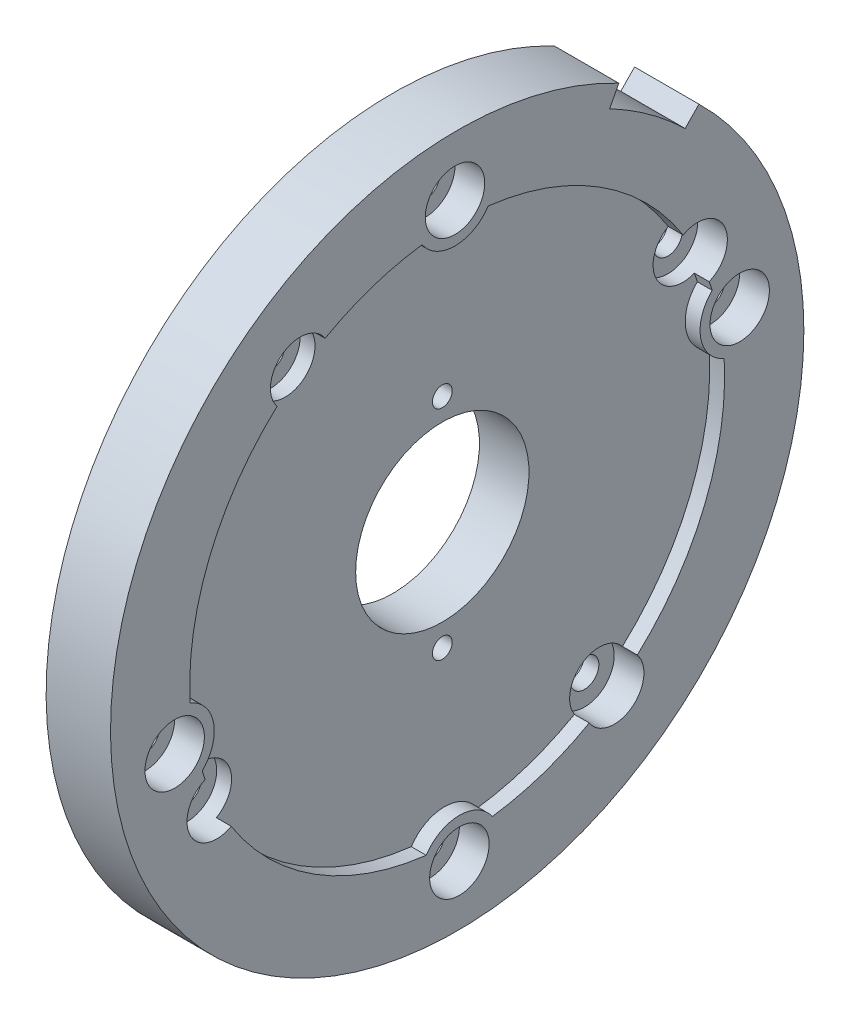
ISO-10303-21;
HEADER;
FILE_DESCRIPTION(('STEP AP214'),'2;1');
FILE_NAME('part.step','',(''),(''),'','','');
FILE_SCHEMA(('AUTOMOTIVE_DESIGN { 1 0 10303 214 1 1 1 1 }'));
ENDSEC;
DATA;
#1=APPLICATION_CONTEXT('core data for automotive mechanical design processes');
#2=APPLICATION_PROTOCOL_DEFINITION('international standard','automotive_design',2000,#1);
#3=PRODUCT_CONTEXT('',#1,'mechanical');
#4=PRODUCT('Part','Part','',(#3));
#5=PRODUCT_RELATED_PRODUCT_CATEGORY('part','',(#4));
#6=PRODUCT_DEFINITION_FORMATION('','',#4);
#7=PRODUCT_DEFINITION_CONTEXT('part definition',#1,'design');
#8=PRODUCT_DEFINITION('design','',#6,#7);
#9=PRODUCT_DEFINITION_SHAPE('','',#8);
#10=(LENGTH_UNIT() NAMED_UNIT(*) SI_UNIT(.MILLI.,.METRE.));
#11=(NAMED_UNIT(*) PLANE_ANGLE_UNIT() SI_UNIT($,.RADIAN.));
#12=(NAMED_UNIT(*) SI_UNIT($,.STERADIAN.) SOLID_ANGLE_UNIT());
#13=UNCERTAINTY_MEASURE_WITH_UNIT(LENGTH_MEASURE(1.E-05),#10,'distance_accuracy_value','');
#14=(GEOMETRIC_REPRESENTATION_CONTEXT(3) GLOBAL_UNCERTAINTY_ASSIGNED_CONTEXT((#13)) GLOBAL_UNIT_ASSIGNED_CONTEXT((#10,
#11,#12)) REPRESENTATION_CONTEXT('',''));
#15=CARTESIAN_POINT('',(0.,0.,0.));
#16=DIRECTION('',(0.,0.,1.));
#17=DIRECTION('',(1.,0.,0.));
#18=AXIS2_PLACEMENT_3D('',#15,#16,#17);
#19=CARTESIAN_POINT('',(-33.9823848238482,0.,0.));
#20=DIRECTION('',(-1.,0.,0.));
#21=DIRECTION('',(0.,0.,1.));
#22=AXIS2_PLACEMENT_3D('',#19,#20,#21);
#23=CYLINDRICAL_SURFACE('',#22,27.);
#24=CARTESIAN_POINT('',(6.5,0.,0.));
#25=DIRECTION('',(-1.,0.,0.));
#26=DIRECTION('',(0.,0.,1.));
#27=AXIS2_PLACEMENT_3D('',#24,#25,#26);
#28=CIRCLE('',#27,27.);
#29=CARTESIAN_POINT('',(6.5,-1.57381848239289,26.9540923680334));
#30=VERTEX_POINT('',#29);
#31=CARTESIAN_POINT('',(6.5,19.9623927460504,18.1797380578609));
#32=VERTEX_POINT('',#31);
#33=EDGE_CURVE('E51',#30,#32,#28,.T.);
#34=ORIENTED_EDGE('',*,*,#33,.F.);
#35=DIRECTION('',(1.,0.,0.));
#36=VECTOR('',#35,1.);
#37=CARTESIAN_POINT('',(-1.99743719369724,-1.57381848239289,26.9540923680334));
#38=LINE('',#37,#36);
#39=CARTESIAN_POINT('',(5.,-1.57381848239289,26.9540923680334));
#40=VERTEX_POINT('',#39);
#41=EDGE_CURVE('E571',#40,#30,#38,.T.);
#42=ORIENTED_EDGE('',*,*,#41,.F.);
#43=CARTESIAN_POINT('',(5.,0.,0.));
#44=DIRECTION('',(-1.,0.,0.));
#45=DIRECTION('',(0.,0.,1.));
#46=AXIS2_PLACEMENT_3D('',#43,#44,#45);
#47=CIRCLE('',#46,27.);
#48=CARTESIAN_POINT('',(5.,19.9623927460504,18.1797380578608));
#49=VERTEX_POINT('',#48);
#50=EDGE_CURVE('E537',#40,#49,#47,.T.);
#51=ORIENTED_EDGE('',*,*,#50,.T.);
#52=DIRECTION('',(1.,0.,0.));
#53=VECTOR('',#52,1.);
#54=CARTESIAN_POINT('',(5.,19.9623927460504,18.1797380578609));
#55=LINE('',#54,#53);
#56=EDGE_CURVE('E337',#49,#32,#55,.T.);
#57=ORIENTED_EDGE('',*,*,#56,.T.);
#58=EDGE_LOOP('',(#34,#42,#51,#57));
#59=FACE_BOUND('',#58,.T.);
#60=ADVANCED_FACE('F26',(#59),#23,.F.);
#61=CARTESIAN_POINT('',(0.,-5.25417946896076,28.5209181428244));
#62=DIRECTION('',(-1.,0.,0.));
#63=DIRECTION('',(0.,0.,1.));
#64=AXIS2_PLACEMENT_3D('',#61,#62,#63);
#65=CYLINDRICAL_SURFACE('',#64,1.45000000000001);
#66=CARTESIAN_POINT('',(2.,-5.25417946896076,28.5209181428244));
#67=DIRECTION('',(-1.,0.,0.));
#68=DIRECTION('',(0.,0.,1.));
#69=AXIS2_PLACEMENT_3D('',#66,#67,#68);
#70=CIRCLE('',#69,1.45000000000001);
#71=CARTESIAN_POINT('',(2.,-5.25417946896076,29.9709181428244));
#72=VERTEX_POINT('',#71);
#73=EDGE_CURVE('E393',#72,#72,#70,.T.);
#74=ORIENTED_EDGE('',*,*,#73,.T.);
#75=EDGE_LOOP('',(#74));
#76=FACE_BOUND('',#75,.T.);
#77=CARTESIAN_POINT('',(3.5,-5.25417946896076,28.5209181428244));
#78=DIRECTION('',(1.,0.,0.));
#79=DIRECTION('',(0.,0.,-1.));
#80=AXIS2_PLACEMENT_3D('',#77,#78,#79);
#81=CIRCLE('',#80,1.45000000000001);
#82=CARTESIAN_POINT('',(3.5,-5.25417946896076,27.0709181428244));
#83=VERTEX_POINT('',#82);
#84=EDGE_CURVE('E30',#83,#83,#81,.F.);
#85=ORIENTED_EDGE('',*,*,#84,.F.);
#86=EDGE_LOOP('',(#85));
#87=FACE_BOUND('',#86,.T.);
#88=ADVANCED_FACE('F621',(#76,#87),#65,.F.);
#89=CARTESIAN_POINT('',(6.5,-26.8178898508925,3.13062037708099));
#90=VERTEX_POINT('',#89);
#91=CARTESIAN_POINT('',(6.5,-14.437113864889,22.8159975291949));
#92=VERTEX_POINT('',#91);
#93=EDGE_CURVE('E266',#90,#92,#28,.T.);
#94=ORIENTED_EDGE('',*,*,#93,.F.);
#95=DIRECTION('',(1.,0.,0.));
#96=VECTOR('',#95,1.);
#97=CARTESIAN_POINT('',(-1.99743719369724,-26.8178898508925,3.13062037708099));
#98=LINE('',#97,#96);
#99=CARTESIAN_POINT('',(5.,-26.8178898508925,3.13062037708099));
#100=VERTEX_POINT('',#99);
#101=EDGE_CURVE('E605',#100,#90,#98,.T.);
#102=ORIENTED_EDGE('',*,*,#101,.F.);
#103=CARTESIAN_POINT('',(5.,-14.437113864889,22.8159975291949));
#104=VERTEX_POINT('',#103);
#105=EDGE_CURVE('E536',#100,#104,#47,.T.);
#106=ORIENTED_EDGE('',*,*,#105,.T.);
#107=DIRECTION('',(1.,0.,0.));
#108=VECTOR('',#107,1.);
#109=CARTESIAN_POINT('',(5.,-14.437113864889,22.8159975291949));
#110=LINE('',#109,#108);
#111=EDGE_CURVE('E350',#104,#92,#110,.T.);
#112=ORIENTED_EDGE('',*,*,#111,.T.);
#113=EDGE_LOOP('',(#94,#102,#106,#112));
#114=FACE_BOUND('',#113,.T.);
#115=ADVANCED_FACE('F623',(#114),#23,.F.);
#116=CARTESIAN_POINT('',(0.,-29.,-0.221751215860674));
#117=DIRECTION('',(-1.,0.,0.));
#118=DIRECTION('',(0.,0.,1.));
#119=AXIS2_PLACEMENT_3D('',#116,#117,#118);
#120=CYLINDRICAL_SURFACE('',#119,1.45);
#121=CARTESIAN_POINT('',(2.,-29.,-0.221751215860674));
#122=DIRECTION('',(-1.,0.,0.));
#123=DIRECTION('',(0.,0.,1.));
#124=AXIS2_PLACEMENT_3D('',#121,#122,#123);
#125=CIRCLE('',#124,1.45000000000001);
#126=CARTESIAN_POINT('',(2.,-29.,1.22824878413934));
#127=VERTEX_POINT('',#126);
#128=EDGE_CURVE('E356',#127,#127,#125,.T.);
#129=ORIENTED_EDGE('',*,*,#128,.T.);
#130=EDGE_LOOP('',(#129));
#131=FACE_BOUND('',#130,.T.);
#132=CARTESIAN_POINT('',(3.5,-29.,-0.221751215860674));
#133=DIRECTION('',(1.,0.,0.));
#134=DIRECTION('',(0.,0.,-1.));
#135=AXIS2_PLACEMENT_3D('',#132,#133,#134);
#136=CIRCLE('',#135,1.45);
#137=CARTESIAN_POINT('',(3.5,-29.,-1.67175121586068));
#138=VERTEX_POINT('',#137);
#139=EDGE_CURVE('E362',#138,#138,#136,.F.);
#140=ORIENTED_EDGE('',*,*,#139,.F.);
#141=EDGE_LOOP('',(#140));
#142=FACE_BOUND('',#141,.T.);
#143=ADVANCED_FACE('F631',(#131,#142),#120,.F.);
#144=CARTESIAN_POINT('',(6.5,1.5738184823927,-26.9540923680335));
#145=VERTEX_POINT('',#144);
#146=CARTESIAN_POINT('',(6.5,-19.9623927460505,-18.1797380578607));
#147=VERTEX_POINT('',#146);
#148=EDGE_CURVE('E535',#145,#147,#28,.T.);
#149=ORIENTED_EDGE('',*,*,#148,.F.);
#150=DIRECTION('',(1.,0.,0.));
#151=VECTOR('',#150,1.);
#152=CARTESIAN_POINT('',(-1.99743719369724,1.5738184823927,-26.9540923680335));
#153=LINE('',#152,#151);
#154=CARTESIAN_POINT('',(5.,1.5738184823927,-26.9540923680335));
#155=VERTEX_POINT('',#154);
#156=EDGE_CURVE('E584',#155,#145,#153,.T.);
#157=ORIENTED_EDGE('',*,*,#156,.F.);
#158=CARTESIAN_POINT('',(5.,-19.9623927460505,-18.1797380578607));
#159=VERTEX_POINT('',#158);
#160=EDGE_CURVE('E532',#155,#159,#47,.T.);
#161=ORIENTED_EDGE('',*,*,#160,.T.);
#162=DIRECTION('',(1.,0.,0.));
#163=VECTOR('',#162,1.);
#164=CARTESIAN_POINT('',(5.,-19.9623927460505,-18.1797380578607));
#165=LINE('',#164,#163);
#166=EDGE_CURVE('E437',#159,#147,#165,.T.);
#167=ORIENTED_EDGE('',*,*,#166,.T.);
#168=EDGE_LOOP('',(#149,#157,#161,#167));
#169=FACE_BOUND('',#168,.T.);
#170=ADVANCED_FACE('F634',(#169),#23,.F.);
#171=CARTESIAN_POINT('',(0.,5.25417946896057,-28.5209181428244));
#172=DIRECTION('',(-1.,0.,0.));
#173=DIRECTION('',(0.,0.,1.));
#174=AXIS2_PLACEMENT_3D('',#171,#172,#173);
#175=CYLINDRICAL_SURFACE('',#174,1.45000000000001);
#176=CARTESIAN_POINT('',(2.,5.25417946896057,-28.5209181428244));
#177=DIRECTION('',(-1.,0.,0.));
#178=DIRECTION('',(0.,0.,1.));
#179=AXIS2_PLACEMENT_3D('',#176,#177,#178);
#180=CIRCLE('',#179,1.45000000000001);
#181=CARTESIAN_POINT('',(2.,5.25417946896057,-27.0709181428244));
#182=VERTEX_POINT('',#181);
#183=EDGE_CURVE('E402',#182,#182,#180,.T.);
#184=ORIENTED_EDGE('',*,*,#183,.T.);
#185=EDGE_LOOP('',(#184));
#186=FACE_BOUND('',#185,.T.);
#187=CARTESIAN_POINT('',(3.5,5.25417946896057,-28.5209181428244));
#188=DIRECTION('',(1.,0.,0.));
#189=DIRECTION('',(0.,0.,-1.));
#190=AXIS2_PLACEMENT_3D('',#187,#188,#189);
#191=CIRCLE('',#190,1.45000000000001);
#192=CARTESIAN_POINT('',(3.5,5.25417946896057,-29.9709181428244));
#193=VERTEX_POINT('',#192);
#194=EDGE_CURVE('E358',#193,#193,#191,.F.);
#195=ORIENTED_EDGE('',*,*,#194,.F.);
#196=EDGE_LOOP('',(#195));
#197=FACE_BOUND('',#196,.T.);
#198=ADVANCED_FACE('F650',(#186,#197),#175,.F.);
#199=CARTESIAN_POINT('',(6.5,26.8178898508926,-3.1306203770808));
#200=VERTEX_POINT('',#199);
#201=CARTESIAN_POINT('',(6.5,14.4371138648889,-22.815997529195));
#202=VERTEX_POINT('',#201);
#203=EDGE_CURVE('E542',#200,#202,#28,.T.);
#204=ORIENTED_EDGE('',*,*,#203,.F.);
#205=DIRECTION('',(1.,0.,0.));
#206=VECTOR('',#205,1.);
#207=CARTESIAN_POINT('',(-1.99743719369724,26.8178898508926,-3.1306203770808));
#208=LINE('',#207,#206);
#209=CARTESIAN_POINT('',(5.,26.8178898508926,-3.1306203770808));
#210=VERTEX_POINT('',#209);
#211=EDGE_CURVE('E595',#210,#200,#208,.T.);
#212=ORIENTED_EDGE('',*,*,#211,.F.);
#213=CARTESIAN_POINT('',(5.,14.4371138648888,-22.815997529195));
#214=VERTEX_POINT('',#213);
#215=EDGE_CURVE('E544',#210,#214,#47,.T.);
#216=ORIENTED_EDGE('',*,*,#215,.T.);
#217=DIRECTION('',(1.,0.,0.));
#218=VECTOR('',#217,1.);
#219=CARTESIAN_POINT('',(5.,14.4371138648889,-22.815997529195));
#220=LINE('',#219,#218);
#221=EDGE_CURVE('E329',#214,#202,#220,.T.);
#222=ORIENTED_EDGE('',*,*,#221,.T.);
#223=EDGE_LOOP('',(#204,#212,#216,#222));
#224=FACE_BOUND('',#223,.T.);
#225=ADVANCED_FACE('F653',(#224),#23,.F.);
#226=CARTESIAN_POINT('',(0.,29.,0.221751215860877));
#227=DIRECTION('',(-1.,0.,0.));
#228=DIRECTION('',(0.,0.,1.));
#229=AXIS2_PLACEMENT_3D('',#226,#227,#228);
#230=CYLINDRICAL_SURFACE('',#229,1.45);
#231=CARTESIAN_POINT('',(2.,29.,0.221751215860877));
#232=DIRECTION('',(-1.,0.,0.));
#233=DIRECTION('',(0.,0.,1.));
#234=AXIS2_PLACEMENT_3D('',#231,#232,#233);
#235=CIRCLE('',#234,1.45000000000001);
#236=CARTESIAN_POINT('',(2.,29.,1.67175121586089));
#237=VERTEX_POINT('',#236);
#238=EDGE_CURVE('E411',#237,#237,#235,.T.);
#239=ORIENTED_EDGE('',*,*,#238,.T.);
#240=EDGE_LOOP('',(#239));
#241=FACE_BOUND('',#240,.T.);
#242=CARTESIAN_POINT('',(3.5,29.,0.221751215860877));
#243=DIRECTION('',(1.,0.,0.));
#244=DIRECTION('',(0.,0.,-1.));
#245=AXIS2_PLACEMENT_3D('',#242,#243,#244);
#246=CIRCLE('',#245,1.45);
#247=CARTESIAN_POINT('',(3.5,29.,-1.22824878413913));
#248=VERTEX_POINT('',#247);
#249=EDGE_CURVE('E353',#248,#248,#246,.F.);
#250=ORIENTED_EDGE('',*,*,#249,.F.);
#251=EDGE_LOOP('',(#250));
#252=FACE_BOUND('',#251,.T.);
#253=ADVANCED_FACE('F663',(#241,#252),#230,.F.);
#254=CARTESIAN_POINT('',(0.,-11.8168002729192,24.2768043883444));
#255=DIRECTION('',(-1.,0.,0.));
#256=DIRECTION('',(0.,0.,1.));
#257=AXIS2_PLACEMENT_3D('',#254,#255,#256);
#258=CYLINDRICAL_SURFACE('',#257,1.45);
#259=CARTESIAN_POINT('',(2.,-11.8168002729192,24.2768043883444));
#260=DIRECTION('',(-1.,0.,0.));
#261=DIRECTION('',(0.,0.,1.));
#262=AXIS2_PLACEMENT_3D('',#259,#260,#261);
#263=CIRCLE('',#262,1.45);
#264=CARTESIAN_POINT('',(2.,-11.8168002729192,25.7268043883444));
#265=VERTEX_POINT('',#264);
#266=EDGE_CURVE('E486',#265,#265,#263,.T.);
#267=ORIENTED_EDGE('',*,*,#266,.T.);
#268=EDGE_LOOP('',(#267));
#269=FACE_BOUND('',#268,.T.);
#270=CARTESIAN_POINT('',(3.5,-11.8168002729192,24.2768043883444));
#271=DIRECTION('',(1.,0.,0.));
#272=DIRECTION('',(0.,0.,-1.));
#273=AXIS2_PLACEMENT_3D('',#270,#271,#272);
#274=CIRCLE('',#273,1.45);
#275=CARTESIAN_POINT('',(3.5,-11.8168002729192,22.8268043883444));
#276=VERTEX_POINT('',#275);
#277=EDGE_CURVE('E348',#276,#276,#274,.F.);
#278=ORIENTED_EDGE('',*,*,#277,.F.);
#279=EDGE_LOOP('',(#278));
#280=FACE_BOUND('',#279,.T.);
#281=ADVANCED_FACE('F666',(#269,#280),#258,.F.);
#282=CARTESIAN_POINT('',(0.,-21.8560193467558,-15.8528993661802));
#283=DIRECTION('',(-1.,0.,0.));
#284=DIRECTION('',(0.,0.,1.));
#285=AXIS2_PLACEMENT_3D('',#282,#283,#284);
#286=CYLINDRICAL_SURFACE('',#285,1.45);
#287=CARTESIAN_POINT('',(2.,-21.8560193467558,-15.8528993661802));
#288=DIRECTION('',(-1.,0.,0.));
#289=DIRECTION('',(0.,0.,1.));
#290=AXIS2_PLACEMENT_3D('',#287,#288,#289);
#291=CIRCLE('',#290,1.45);
#292=CARTESIAN_POINT('',(2.,-21.8560193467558,-14.4028993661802));
#293=VERTEX_POINT('',#292);
#294=EDGE_CURVE('E498',#293,#293,#291,.T.);
#295=ORIENTED_EDGE('',*,*,#294,.T.);
#296=EDGE_LOOP('',(#295));
#297=FACE_BOUND('',#296,.T.);
#298=CARTESIAN_POINT('',(3.5,-21.8560193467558,-15.8528993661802));
#299=DIRECTION('',(1.,0.,0.));
#300=DIRECTION('',(0.,0.,-1.));
#301=AXIS2_PLACEMENT_3D('',#298,#299,#300);
#302=CIRCLE('',#301,1.45);
#303=CARTESIAN_POINT('',(3.5,-21.8560193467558,-17.3028993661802));
#304=VERTEX_POINT('',#303);
#305=EDGE_CURVE('E341',#304,#304,#302,.F.);
#306=ORIENTED_EDGE('',*,*,#305,.F.);
#307=EDGE_LOOP('',(#306));
#308=FACE_BOUND('',#307,.T.);
#309=ADVANCED_FACE('F732',(#297,#308),#286,.F.);
#310=CARTESIAN_POINT('',(0.,21.8560193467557,15.8528993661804));
#311=DIRECTION('',(-1.,0.,0.));
#312=DIRECTION('',(0.,0.,1.));
#313=AXIS2_PLACEMENT_3D('',#310,#311,#312);
#314=CYLINDRICAL_SURFACE('',#313,1.45);
#315=CARTESIAN_POINT('',(2.,21.8560193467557,15.8528993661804));
#316=DIRECTION('',(-1.,0.,0.));
#317=DIRECTION('',(0.,0.,1.));
#318=AXIS2_PLACEMENT_3D('',#315,#316,#317);
#319=CIRCLE('',#318,1.45);
#320=CARTESIAN_POINT('',(2.,21.8560193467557,17.3028993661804));
#321=VERTEX_POINT('',#320);
#322=EDGE_CURVE('E474',#321,#321,#319,.T.);
#323=ORIENTED_EDGE('',*,*,#322,.T.);
#324=EDGE_LOOP('',(#323));
#325=FACE_BOUND('',#324,.T.);
#326=CARTESIAN_POINT('',(3.5,21.8560193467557,15.8528993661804));
#327=DIRECTION('',(1.,0.,0.));
#328=DIRECTION('',(0.,0.,-1.));
#329=AXIS2_PLACEMENT_3D('',#326,#327,#328);
#330=CIRCLE('',#329,1.45);
#331=CARTESIAN_POINT('',(3.5,21.8560193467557,14.4028993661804));
#332=VERTEX_POINT('',#331);
#333=EDGE_CURVE('E334',#332,#332,#330,.F.);
#334=ORIENTED_EDGE('',*,*,#333,.F.);
#335=EDGE_LOOP('',(#334));
#336=FACE_BOUND('',#335,.T.);
#337=ADVANCED_FACE('F720',(#325,#336),#314,.F.);
#338=CARTESIAN_POINT('',(0.,11.816800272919,-24.2768043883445));
#339=DIRECTION('',(-1.,0.,0.));
#340=DIRECTION('',(0.,0.,1.));
#341=AXIS2_PLACEMENT_3D('',#338,#339,#340);
#342=CYLINDRICAL_SURFACE('',#341,1.45);
#343=CARTESIAN_POINT('',(2.,11.816800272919,-24.2768043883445));
#344=DIRECTION('',(-1.,0.,0.));
#345=DIRECTION('',(0.,0.,1.));
#346=AXIS2_PLACEMENT_3D('',#343,#344,#345);
#347=CIRCLE('',#346,1.45);
#348=CARTESIAN_POINT('',(2.,11.816800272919,-22.8268043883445));
#349=VERTEX_POINT('',#348);
#350=EDGE_CURVE('E462',#349,#349,#347,.T.);
#351=ORIENTED_EDGE('',*,*,#350,.T.);
#352=EDGE_LOOP('',(#351));
#353=FACE_BOUND('',#352,.T.);
#354=CARTESIAN_POINT('',(3.5,11.816800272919,-24.2768043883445));
#355=DIRECTION('',(1.,0.,0.));
#356=DIRECTION('',(0.,0.,-1.));
#357=AXIS2_PLACEMENT_3D('',#354,#355,#356);
#358=CIRCLE('',#357,1.45);
#359=CARTESIAN_POINT('',(3.5,11.816800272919,-25.7268043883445));
#360=VERTEX_POINT('',#359);
#361=EDGE_CURVE('E326',#360,#360,#358,.F.);
#362=ORIENTED_EDGE('',*,*,#361,.F.);
#363=EDGE_LOOP('',(#362));
#364=FACE_BOUND('',#363,.T.);
#365=ADVANCED_FACE('F716',(#353,#364),#342,.F.);
#366=CARTESIAN_POINT('',(5.,9.0506002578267,-25.4378976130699));
#367=VERTEX_POINT('',#366);
#368=CARTESIAN_POINT('',(5.,8.13459514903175,-25.7454532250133));
#369=VERTEX_POINT('',#368);
#370=EDGE_CURVE('E538',#367,#369,#47,.T.);
#371=ORIENTED_EDGE('',*,*,#370,.T.);
#372=DIRECTION('',(1.,0.,0.));
#373=VECTOR('',#372,1.);
#374=CARTESIAN_POINT('',(-1.99743719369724,8.13459514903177,-25.7454532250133));
#375=LINE('',#374,#373);
#376=CARTESIAN_POINT('',(6.5,8.13459514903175,-25.7454532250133));
#377=VERTEX_POINT('',#376);
#378=EDGE_CURVE('E580',#369,#377,#375,.T.);
#379=ORIENTED_EDGE('',*,*,#378,.T.);
#380=CARTESIAN_POINT('',(6.5,9.05060025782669,-25.4378976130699));
#381=VERTEX_POINT('',#380);
#382=EDGE_CURVE('E268',#381,#377,#28,.T.);
#383=ORIENTED_EDGE('',*,*,#382,.F.);
#384=DIRECTION('',(1.,0.,0.));
#385=VECTOR('',#384,1.);
#386=CARTESIAN_POINT('',(5.,9.05060025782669,-25.4378976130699));
#387=LINE('',#386,#385);
#388=EDGE_CURVE('E456',#381,#367,#387,.F.);
#389=ORIENTED_EDGE('',*,*,#388,.T.);
#390=EDGE_LOOP('',(#371,#379,#383,#389));
#391=FACE_BOUND('',#390,.T.);
#392=ADVANCED_FACE('F719',(#391),#23,.F.);
#393=CARTESIAN_POINT('',(5.,23.4798185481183,13.33034586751));
#394=VERTEX_POINT('',#393);
#395=CARTESIAN_POINT('',(5.,26.7668795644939,3.54036133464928));
#396=VERTEX_POINT('',#395);
#397=EDGE_CURVE('E545',#394,#396,#47,.T.);
#398=ORIENTED_EDGE('',*,*,#397,.T.);
#399=DIRECTION('',(1.,0.,0.));
#400=VECTOR('',#399,1.);
#401=CARTESIAN_POINT('',(-1.99743719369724,26.7668795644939,3.5403613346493));
#402=LINE('',#401,#400);
#403=CARTESIAN_POINT('',(6.5,26.7668795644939,3.54036133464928));
#404=VERTEX_POINT('',#403);
#405=EDGE_CURVE('E591',#396,#404,#402,.T.);
#406=ORIENTED_EDGE('',*,*,#405,.T.);
#407=CARTESIAN_POINT('',(6.5,23.4798185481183,13.33034586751));
#408=VERTEX_POINT('',#407);
#409=EDGE_CURVE('E1112',#408,#404,#28,.T.);
#410=ORIENTED_EDGE('',*,*,#409,.F.);
#411=DIRECTION('',(1.,0.,0.));
#412=VECTOR('',#411,1.);
#413=CARTESIAN_POINT('',(5.,23.4798185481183,13.33034586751));
#414=LINE('',#413,#412);
#415=EDGE_CURVE('E446',#408,#394,#414,.F.);
#416=ORIENTED_EDGE('',*,*,#415,.T.);
#417=EDGE_LOOP('',(#398,#406,#410,#416));
#418=FACE_BOUND('',#417,.T.);
#419=ADVANCED_FACE('F1090',(#418),#23,.F.);
#420=CARTESIAN_POINT('',(5.,-9.05060025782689,25.4378976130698));
#421=VERTEX_POINT('',#420);
#422=CARTESIAN_POINT('',(5.,-8.13459514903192,25.7454532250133));
#423=VERTEX_POINT('',#422);
#424=EDGE_CURVE('E543',#421,#423,#47,.T.);
#425=ORIENTED_EDGE('',*,*,#424,.T.);
#426=DIRECTION('',(1.,0.,0.));
#427=VECTOR('',#426,1.);
#428=CARTESIAN_POINT('',(-1.99743719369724,-8.13459514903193,25.7454532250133));
#429=LINE('',#428,#427);
#430=CARTESIAN_POINT('',(6.5,-8.13459514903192,25.7454532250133));
#431=VERTEX_POINT('',#430);
#432=EDGE_CURVE('E560',#423,#431,#429,.T.);
#433=ORIENTED_EDGE('',*,*,#432,.T.);
#434=CARTESIAN_POINT('',(6.5,-9.05060025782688,25.4378976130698));
#435=VERTEX_POINT('',#434);
#436=EDGE_CURVE('E1114',#435,#431,#28,.T.);
#437=ORIENTED_EDGE('',*,*,#436,.F.);
#438=DIRECTION('',(1.,0.,0.));
#439=VECTOR('',#438,1.);
#440=CARTESIAN_POINT('',(5.,-9.05060025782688,25.4378976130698));
#441=LINE('',#440,#439);
#442=EDGE_CURVE('E427',#435,#421,#441,.F.);
#443=ORIENTED_EDGE('',*,*,#442,.T.);
#444=EDGE_LOOP('',(#425,#433,#437,#443));
#445=FACE_BOUND('',#444,.T.);
#446=ADVANCED_FACE('F558',(#445),#23,.F.);
#447=CARTESIAN_POINT('',(-33.9823848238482,0.,0.));
#448=DIRECTION('',(-1.,0.,0.));
#449=DIRECTION('',(0.,0.,1.));
#450=AXIS2_PLACEMENT_3D('',#447,#448,#449);
#451=CYLINDRICAL_SURFACE('',#450,12.);
#452=CARTESIAN_POINT('',(0.,0.,0.));
#453=DIRECTION('',(-1.,0.,0.));
#454=DIRECTION('',(0.,0.,1.));
#455=AXIS2_PLACEMENT_3D('',#452,#453,#454);
#456=CIRCLE('',#455,12.);
#457=CARTESIAN_POINT('',(0.,-11.8153409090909,2.09707396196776));
#458=VERTEX_POINT('',#457);
#459=CARTESIAN_POINT('',(0.,11.8153409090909,2.09707396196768));
#460=VERTEX_POINT('',#459);
#461=EDGE_CURVE('E282',#458,#460,#456,.T.);
#462=ORIENTED_EDGE('',*,*,#461,.F.);
#463=DIRECTION('',(-1.,0.,0.));
#464=VECTOR('',#463,1.);
#465=CARTESIAN_POINT('',(1.25,-11.8153409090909,2.09707396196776));
#466=LINE('',#465,#464);
#467=CARTESIAN_POINT('',(2.5,-11.8153409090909,2.09707396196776));
#468=VERTEX_POINT('',#467);
#469=EDGE_CURVE('E518',#458,#468,#466,.F.);
#470=ORIENTED_EDGE('',*,*,#469,.T.);
#471=CARTESIAN_POINT('',(2.5,0.,0.));
#472=DIRECTION('',(-1.,0.,0.));
#473=DIRECTION('',(0.,0.,1.));
#474=AXIS2_PLACEMENT_3D('',#471,#472,#473);
#475=CIRCLE('',#474,12.);
#476=CARTESIAN_POINT('',(2.5,11.8153409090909,2.09707396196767));
#477=VERTEX_POINT('',#476);
#478=EDGE_CURVE('E278',#468,#477,#475,.T.);
#479=ORIENTED_EDGE('',*,*,#478,.T.);
#480=DIRECTION('',(-1.,0.,0.));
#481=VECTOR('',#480,1.);
#482=CARTESIAN_POINT('',(1.25,11.8153409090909,2.09707396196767));
#483=LINE('',#482,#481);
#484=EDGE_CURVE('E524',#477,#460,#483,.T.);
#485=ORIENTED_EDGE('',*,*,#484,.T.);
#486=EDGE_LOOP('',(#462,#470,#479,#485));
#487=FACE_BOUND('',#486,.T.);
#488=ADVANCED_FACE('F797',(#487),#451,.T.);
#489=CARTESIAN_POINT('',(-33.9823848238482,0.,0.));
#490=DIRECTION('',(-1.,0.,0.));
#491=DIRECTION('',(0.,0.,1.));
#492=AXIS2_PLACEMENT_3D('',#489,#490,#491);
#493=CYLINDRICAL_SURFACE('',#492,8.75);
#494=CARTESIAN_POINT('',(0.,0.,0.));
#495=DIRECTION('',(-1.,0.,0.));
#496=DIRECTION('',(0.,0.,1.));
#497=AXIS2_PLACEMENT_3D('',#494,#495,#496);
#498=CIRCLE('',#497,8.75);
#499=CARTESIAN_POINT('',(0.,0.,8.75));
#500=VERTEX_POINT('',#499);
#501=EDGE_CURVE('E286',#500,#500,#498,.T.);
#502=ORIENTED_EDGE('',*,*,#501,.T.);
#503=EDGE_LOOP('',(#502));
#504=FACE_BOUND('',#503,.T.);
#505=CARTESIAN_POINT('',(5.,0.,0.));
#506=DIRECTION('',(-1.,0.,0.));
#507=DIRECTION('',(0.,0.,1.));
#508=AXIS2_PLACEMENT_3D('',#505,#506,#507);
#509=CIRCLE('',#508,8.75);
#510=CARTESIAN_POINT('',(5.,0.,8.75));
#511=VERTEX_POINT('',#510);
#512=EDGE_CURVE('E530',#511,#511,#509,.T.);
#513=ORIENTED_EDGE('',*,*,#512,.F.);
#514=EDGE_LOOP('',(#513));
#515=FACE_BOUND('',#514,.T.);
#516=ADVANCED_FACE('F28',(#504,#515),#493,.F.);
#517=CARTESIAN_POINT('',(0.,8.75,0.));
#518=DIRECTION('',(1.,0.,0.));
#519=DIRECTION('',(0.,0.,-1.));
#520=AXIS2_PLACEMENT_3D('',#517,#518,#519);
#521=PLANE('',#520);
#522=CARTESIAN_POINT('',(0.,-11.,0.));
#523=DIRECTION('',(-1.,0.,0.));
#524=DIRECTION('',(0.,0.,1.));
#525=AXIS2_PLACEMENT_3D('',#522,#523,#524);
#526=CIRCLE('',#525,1.);
#527=CARTESIAN_POINT('',(0.,-11.,1.00000000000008));
#528=VERTEX_POINT('',#527);
#529=EDGE_CURVE('E301',#528,#528,#526,.T.);
#530=ORIENTED_EDGE('',*,*,#529,.F.);
#531=EDGE_LOOP('',(#530));
#532=FACE_BOUND('',#531,.T.);
#533=CARTESIAN_POINT('',(0.,11.,0.));
#534=DIRECTION('',(-1.,0.,0.));
#535=DIRECTION('',(0.,0.,1.));
#536=AXIS2_PLACEMENT_3D('',#533,#534,#535);
#537=CIRCLE('',#536,1.);
#538=CARTESIAN_POINT('',(0.,11.,1.));
#539=VERTEX_POINT('',#538);
#540=EDGE_CURVE('E297',#539,#539,#537,.T.);
#541=ORIENTED_EDGE('',*,*,#540,.F.);
#542=EDGE_LOOP('',(#541));
#543=FACE_BOUND('',#542,.T.);
#544=CARTESIAN_POINT('',(0.,-11.,0.));
#545=DIRECTION('',(-1.,0.,0.));
#546=DIRECTION('',(0.,0.,-1.));
#547=AXIS2_PLACEMENT_3D('',#544,#545,#546);
#548=CIRCLE('',#547,2.25);
#549=CARTESIAN_POINT('',(0.,-11.8153409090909,-2.09707396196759));
#550=VERTEX_POINT('',#549);
#551=EDGE_CURVE('E296',#550,#458,#548,.T.);
#552=ORIENTED_EDGE('',*,*,#551,.T.);
#553=ORIENTED_EDGE('',*,*,#461,.T.);
#554=CARTESIAN_POINT('',(0.,11.,0.));
#555=DIRECTION('',(-1.,0.,0.));
#556=DIRECTION('',(0.,0.,1.));
#557=AXIS2_PLACEMENT_3D('',#554,#555,#556);
#558=CIRCLE('',#557,2.25);
#559=CARTESIAN_POINT('',(0.,11.8153409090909,-2.09707396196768));
#560=VERTEX_POINT('',#559);
#561=EDGE_CURVE('E521',#460,#560,#558,.T.);
#562=ORIENTED_EDGE('',*,*,#561,.T.);
#563=EDGE_CURVE('E283',#560,#550,#456,.T.);
#564=ORIENTED_EDGE('',*,*,#563,.T.);
#565=EDGE_LOOP('',(#552,#553,#562,#564));
#566=FACE_BOUND('',#565,.T.);
#567=ORIENTED_EDGE('',*,*,#501,.F.);
#568=EDGE_LOOP('',(#567));
#569=FACE_BOUND('',#568,.T.);
#570=ADVANCED_FACE('F795',(#532,#543,#566,#569),#521,.F.);
#571=CARTESIAN_POINT('',(2.5,11.8153409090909,-2.09707396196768));
#572=VERTEX_POINT('',#571);
#573=CARTESIAN_POINT('',(2.5,-11.8153409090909,-2.09707396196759));
#574=VERTEX_POINT('',#573);
#575=EDGE_CURVE('E279',#572,#574,#475,.T.);
#576=ORIENTED_EDGE('',*,*,#575,.T.);
#577=DIRECTION('',(-1.,0.,0.));
#578=VECTOR('',#577,1.);
#579=CARTESIAN_POINT('',(1.25,-11.8153409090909,-2.09707396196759));
#580=LINE('',#579,#578);
#581=EDGE_CURVE('E515',#574,#550,#580,.T.);
#582=ORIENTED_EDGE('',*,*,#581,.T.);
#583=ORIENTED_EDGE('',*,*,#563,.F.);
#584=DIRECTION('',(-1.,0.,0.));
#585=VECTOR('',#584,1.);
#586=CARTESIAN_POINT('',(1.25,11.8153409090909,-2.09707396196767));
#587=LINE('',#586,#585);
#588=EDGE_CURVE('E527',#560,#572,#587,.F.);
#589=ORIENTED_EDGE('',*,*,#588,.T.);
#590=EDGE_LOOP('',(#576,#582,#583,#589));
#591=FACE_BOUND('',#590,.T.);
#592=ADVANCED_FACE('F792',(#591),#451,.T.);
#593=CARTESIAN_POINT('',(2.5,12.,0.));
#594=DIRECTION('',(1.,0.,0.));
#595=DIRECTION('',(0.,0.,-1.));
#596=AXIS2_PLACEMENT_3D('',#593,#594,#595);
#597=PLANE('',#596);
#598=ORIENTED_EDGE('',*,*,#478,.F.);
#599=CARTESIAN_POINT('',(2.5,-11.,0.));
#600=DIRECTION('',(1.,0.,0.));
#601=DIRECTION('',(0.,0.,-1.));
#602=AXIS2_PLACEMENT_3D('',#599,#600,#601);
#603=CIRCLE('',#602,2.25);
#604=EDGE_CURVE('E513',#574,#468,#603,.F.);
#605=ORIENTED_EDGE('',*,*,#604,.F.);
#606=ORIENTED_EDGE('',*,*,#575,.F.);
#607=CARTESIAN_POINT('',(2.5,11.,0.));
#608=DIRECTION('',(1.,0.,0.));
#609=DIRECTION('',(0.,0.,-1.));
#610=AXIS2_PLACEMENT_3D('',#607,#608,#609);
#611=CIRCLE('',#610,2.25);
#612=EDGE_CURVE('E289',#572,#477,#611,.T.);
#613=ORIENTED_EDGE('',*,*,#612,.T.);
#614=EDGE_LOOP('',(#598,#605,#606,#613));
#615=FACE_BOUND('',#614,.T.);
#616=CARTESIAN_POINT('',(2.5,0.,0.));
#617=DIRECTION('',(-1.,0.,0.));
#618=DIRECTION('',(0.,0.,1.));
#619=AXIS2_PLACEMENT_3D('',#616,#617,#618);
#620=CIRCLE('',#619,24.5);
#621=CARTESIAN_POINT('',(2.5,0.,24.5));
#622=VERTEX_POINT('',#621);
#623=EDGE_CURVE('E274',#622,#622,#620,.T.);
#624=ORIENTED_EDGE('',*,*,#623,.T.);
#625=EDGE_LOOP('',(#624));
#626=FACE_BOUND('',#625,.T.);
#627=ADVANCED_FACE('F788',(#615,#626),#597,.F.);
#628=CARTESIAN_POINT('',(-33.9823848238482,0.,0.));
#629=DIRECTION('',(-1.,0.,0.));
#630=DIRECTION('',(0.,0.,1.));
#631=AXIS2_PLACEMENT_3D('',#628,#629,#630);
#632=CYLINDRICAL_SURFACE('',#631,24.5);
#633=ORIENTED_EDGE('',*,*,#623,.F.);
#634=EDGE_LOOP('',(#633));
#635=FACE_BOUND('',#634,.T.);
#636=CARTESIAN_POINT('',(2.,0.,0.));
#637=DIRECTION('',(1.,0.,0.));
#638=DIRECTION('',(0.,0.,-1.));
#639=AXIS2_PLACEMENT_3D('',#636,#637,#638);
#640=CIRCLE('',#639,24.5);
#641=CARTESIAN_POINT('',(2.,11.6930186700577,-21.5295915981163));
#642=VERTEX_POINT('',#641);
#643=CARTESIAN_POINT('',(2.,9.73101042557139,-22.484604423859));
#644=VERTEX_POINT('',#643);
#645=EDGE_CURVE('E322',#642,#644,#640,.F.);
#646=ORIENTED_EDGE('',*,*,#645,.T.);
#647=DIRECTION('',(-1.,0.,0.));
#648=VECTOR('',#647,1.);
#649=CARTESIAN_POINT('',(1.,9.73101042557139,-22.484604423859));
#650=LINE('',#649,#648);
#651=CARTESIAN_POINT('',(0.,9.73101042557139,-22.484604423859));
#652=VERTEX_POINT('',#651);
#653=EDGE_CURVE('E468',#644,#652,#650,.T.);
#654=ORIENTED_EDGE('',*,*,#653,.T.);
#655=CARTESIAN_POINT('',(0.,0.,0.));
#656=DIRECTION('',(-1.,0.,0.));
#657=DIRECTION('',(0.,0.,1.));
#658=AXIS2_PLACEMENT_3D('',#655,#656,#657);
#659=CIRCLE('',#658,24.5);
#660=CARTESIAN_POINT('',(0.,-19.1720373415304,-15.2539497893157));
#661=VERTEX_POINT('',#660);
#662=EDGE_CURVE('E263',#652,#661,#659,.T.);
#663=ORIENTED_EDGE('',*,*,#662,.T.);
#664=DIRECTION('',(-1.,0.,0.));
#665=VECTOR('',#664,1.);
#666=CARTESIAN_POINT('',(1.,-19.1720373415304,-15.2539497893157));
#667=LINE('',#666,#665);
#668=CARTESIAN_POINT('',(2.,-19.1720373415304,-15.2539497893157));
#669=VERTEX_POINT('',#668);
#670=EDGE_CURVE('E501',#661,#669,#667,.F.);
#671=ORIENTED_EDGE('',*,*,#670,.T.);
#672=CARTESIAN_POINT('',(2.,0.,0.));
#673=DIRECTION('',(1.,0.,0.));
#674=DIRECTION('',(0.,0.,-1.));
#675=AXIS2_PLACEMENT_3D('',#672,#673,#674);
#676=CIRCLE('',#675,24.5);
#677=CARTESIAN_POINT('',(2.,-20.4532405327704,-13.4875850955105));
#678=VERTEX_POINT('',#677);
#679=EDGE_CURVE('E304',#669,#678,#676,.F.);
#680=ORIENTED_EDGE('',*,*,#679,.T.);
#681=DIRECTION('',(-1.,0.,0.));
#682=VECTOR('',#681,1.);
#683=CARTESIAN_POINT('',(1.,-20.4532405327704,-13.4875850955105));
#684=LINE('',#683,#682);
#685=CARTESIAN_POINT('',(0.,-20.4532405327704,-13.4875850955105));
#686=VERTEX_POINT('',#685);
#687=EDGE_CURVE('E504',#678,#686,#684,.T.);
#688=ORIENTED_EDGE('',*,*,#687,.T.);
#689=CARTESIAN_POINT('',(0.,-11.6930186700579,21.5295915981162));
#690=VERTEX_POINT('',#689);
#691=EDGE_CURVE('E271',#686,#690,#659,.T.);
#692=ORIENTED_EDGE('',*,*,#691,.T.);
#693=DIRECTION('',(-1.,0.,0.));
#694=VECTOR('',#693,1.);
#695=CARTESIAN_POINT('',(1.,-11.6930186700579,21.5295915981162));
#696=LINE('',#695,#694);
#697=CARTESIAN_POINT('',(2.,-11.6930186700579,21.5295915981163));
#698=VERTEX_POINT('',#697);
#699=EDGE_CURVE('E489',#690,#698,#696,.F.);
#700=ORIENTED_EDGE('',*,*,#699,.T.);
#701=CARTESIAN_POINT('',(2.,0.,0.));
#702=DIRECTION('',(1.,0.,0.));
#703=DIRECTION('',(0.,0.,-1.));
#704=AXIS2_PLACEMENT_3D('',#701,#702,#703);
#705=CIRCLE('',#704,24.5);
#706=CARTESIAN_POINT('',(2.,-9.73101042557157,22.484604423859));
#707=VERTEX_POINT('',#706);
#708=EDGE_CURVE('E310',#698,#707,#705,.F.);
#709=ORIENTED_EDGE('',*,*,#708,.T.);
#710=DIRECTION('',(-1.,0.,0.));
#711=VECTOR('',#710,1.);
#712=CARTESIAN_POINT('',(1.,-9.73101042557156,22.484604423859));
#713=LINE('',#712,#711);
#714=CARTESIAN_POINT('',(0.,-9.73101042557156,22.484604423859));
#715=VERTEX_POINT('',#714);
#716=EDGE_CURVE('E492',#707,#715,#713,.T.);
#717=ORIENTED_EDGE('',*,*,#716,.T.);
#718=CARTESIAN_POINT('',(0.,19.1720373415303,15.2539497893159));
#719=VERTEX_POINT('',#718);
#720=EDGE_CURVE('E275',#715,#719,#659,.T.);
#721=ORIENTED_EDGE('',*,*,#720,.T.);
#722=DIRECTION('',(-1.,0.,0.));
#723=VECTOR('',#722,1.);
#724=CARTESIAN_POINT('',(1.,19.1720373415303,15.2539497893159));
#725=LINE('',#724,#723);
#726=CARTESIAN_POINT('',(2.,19.1720373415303,15.2539497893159));
#727=VERTEX_POINT('',#726);
#728=EDGE_CURVE('E477',#719,#727,#725,.F.);
#729=ORIENTED_EDGE('',*,*,#728,.T.);
#730=CARTESIAN_POINT('',(2.,0.,0.));
#731=DIRECTION('',(1.,0.,0.));
#732=DIRECTION('',(0.,0.,-1.));
#733=AXIS2_PLACEMENT_3D('',#730,#731,#732);
#734=CIRCLE('',#733,24.5);
#735=CARTESIAN_POINT('',(2.,20.4532405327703,13.4875850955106));
#736=VERTEX_POINT('',#735);
#737=EDGE_CURVE('E316',#727,#736,#734,.F.);
#738=ORIENTED_EDGE('',*,*,#737,.T.);
#739=DIRECTION('',(-1.,0.,0.));
#740=VECTOR('',#739,1.);
#741=CARTESIAN_POINT('',(1.,20.4532405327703,13.4875850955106));
#742=LINE('',#741,#740);
#743=CARTESIAN_POINT('',(0.,20.4532405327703,13.4875850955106));
#744=VERTEX_POINT('',#743);
#745=EDGE_CURVE('E480',#736,#744,#742,.T.);
#746=ORIENTED_EDGE('',*,*,#745,.T.);
#747=CARTESIAN_POINT('',(0.,11.6930186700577,-21.5295915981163));
#748=VERTEX_POINT('',#747);
#749=EDGE_CURVE('E831',#744,#748,#659,.T.);
#750=ORIENTED_EDGE('',*,*,#749,.T.);
#751=DIRECTION('',(-1.,0.,0.));
#752=VECTOR('',#751,1.);
#753=CARTESIAN_POINT('',(1.,11.6930186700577,-21.5295915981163));
#754=LINE('',#753,#752);
#755=EDGE_CURVE('E465',#748,#642,#754,.F.);
#756=ORIENTED_EDGE('',*,*,#755,.T.);
#757=EDGE_LOOP('',(#646,#654,#663,#671,#680,#688,#692,#700,#709,#717,#721,#729,#738,#746,#750,#756));
#758=FACE_BOUND('',#757,.T.);
#759=ADVANCED_FACE('F784',(#635,#758),#632,.F.);
#760=CARTESIAN_POINT('',(0.,24.5,0.));
#761=DIRECTION('',(1.,0.,0.));
#762=DIRECTION('',(0.,0.,-1.));
#763=AXIS2_PLACEMENT_3D('',#760,#761,#762);
#764=PLANE('',#763);
#765=CARTESIAN_POINT('',(0.,-29.,-0.221751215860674));
#766=DIRECTION('',(-1.,0.,0.));
#767=DIRECTION('',(0.,0.,1.));
#768=AXIS2_PLACEMENT_3D('',#765,#766,#767);
#769=CIRCLE('',#768,2.75);
#770=CARTESIAN_POINT('',(0.,-29.,2.52824878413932));
#771=VERTEX_POINT('',#770);
#772=EDGE_CURVE('E390',#771,#771,#769,.T.);
#773=ORIENTED_EDGE('',*,*,#772,.F.);
#774=EDGE_LOOP('',(#773));
#775=FACE_BOUND('',#774,.T.);
#776=CARTESIAN_POINT('',(0.,-5.25417946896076,28.5209181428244));
#777=DIRECTION('',(-1.,0.,0.));
#778=DIRECTION('',(0.,0.,1.));
#779=AXIS2_PLACEMENT_3D('',#776,#777,#778);
#780=CIRCLE('',#779,2.75);
#781=CARTESIAN_POINT('',(0.,-5.25417946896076,31.2709181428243));
#782=VERTEX_POINT('',#781);
#783=EDGE_CURVE('E399',#782,#782,#780,.T.);
#784=ORIENTED_EDGE('',*,*,#783,.F.);
#785=EDGE_LOOP('',(#784));
#786=FACE_BOUND('',#785,.T.);
#787=CARTESIAN_POINT('',(0.,5.25417946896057,-28.5209181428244));
#788=DIRECTION('',(-1.,0.,0.));
#789=DIRECTION('',(0.,0.,1.));
#790=AXIS2_PLACEMENT_3D('',#787,#788,#789);
#791=CIRCLE('',#790,2.75);
#792=CARTESIAN_POINT('',(0.,5.25417946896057,-25.7709181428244));
#793=VERTEX_POINT('',#792);
#794=EDGE_CURVE('E408',#793,#793,#791,.T.);
#795=ORIENTED_EDGE('',*,*,#794,.F.);
#796=EDGE_LOOP('',(#795));
#797=FACE_BOUND('',#796,.T.);
#798=CARTESIAN_POINT('',(0.,29.,0.221751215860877));
#799=DIRECTION('',(-1.,0.,0.));
#800=DIRECTION('',(0.,0.,1.));
#801=AXIS2_PLACEMENT_3D('',#798,#799,#800);
#802=CIRCLE('',#801,2.75);
#803=CARTESIAN_POINT('',(0.,29.,2.97175121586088));
#804=VERTEX_POINT('',#803);
#805=EDGE_CURVE('E417',#804,#804,#802,.T.);
#806=ORIENTED_EDGE('',*,*,#805,.F.);
#807=EDGE_LOOP('',(#806));
#808=FACE_BOUND('',#807,.T.);
#809=ORIENTED_EDGE('',*,*,#662,.F.);
#810=CARTESIAN_POINT('',(0.,11.816800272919,-24.2768043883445));
#811=DIRECTION('',(1.,0.,0.));
#812=DIRECTION('',(0.,0.,-1.));
#813=AXIS2_PLACEMENT_3D('',#810,#811,#812);
#814=CIRCLE('',#813,2.75);
#815=EDGE_CURVE('E319',#652,#748,#814,.T.);
#816=ORIENTED_EDGE('',*,*,#815,.T.);
#817=ORIENTED_EDGE('',*,*,#749,.F.);
#818=CARTESIAN_POINT('',(0.,21.8560193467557,15.8528993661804));
#819=DIRECTION('',(1.,0.,0.));
#820=DIRECTION('',(0.,0.,-1.));
#821=AXIS2_PLACEMENT_3D('',#818,#819,#820);
#822=CIRCLE('',#821,2.75);
#823=EDGE_CURVE('E313',#744,#719,#822,.T.);
#824=ORIENTED_EDGE('',*,*,#823,.T.);
#825=ORIENTED_EDGE('',*,*,#720,.F.);
#826=CARTESIAN_POINT('',(0.,-11.8168002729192,24.2768043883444));
#827=DIRECTION('',(1.,0.,0.));
#828=DIRECTION('',(0.,0.,-1.));
#829=AXIS2_PLACEMENT_3D('',#826,#827,#828);
#830=CIRCLE('',#829,2.75);
#831=EDGE_CURVE('E307',#715,#690,#830,.T.);
#832=ORIENTED_EDGE('',*,*,#831,.T.);
#833=ORIENTED_EDGE('',*,*,#691,.F.);
#834=CARTESIAN_POINT('',(0.,-21.8560193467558,-15.8528993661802));
#835=DIRECTION('',(1.,0.,0.));
#836=DIRECTION('',(0.,0.,-1.));
#837=AXIS2_PLACEMENT_3D('',#834,#835,#836);
#838=CIRCLE('',#837,2.75);
#839=EDGE_CURVE('E292',#686,#661,#838,.T.);
#840=ORIENTED_EDGE('',*,*,#839,.T.);
#841=EDGE_LOOP('',(#809,#816,#817,#824,#825,#832,#833,#840));
#842=FACE_BOUND('',#841,.T.);
#843=CARTESIAN_POINT('',(0.,0.,0.));
#844=DIRECTION('',(-1.,0.,0.));
#845=DIRECTION('',(0.,0.,1.));
#846=AXIS2_PLACEMENT_3D('',#843,#844,#845);
#847=CIRCLE('',#846,35.);
#848=CARTESIAN_POINT('',(0.,25.0862445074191,-24.4065633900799));
#849=VERTEX_POINT('',#848);
#850=CARTESIAN_POINT('',(0.,30.9640970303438,-16.3163934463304));
#851=VERTEX_POINT('',#850);
#852=EDGE_CURVE('E254',#849,#851,#847,.T.);
#853=ORIENTED_EDGE('',*,*,#852,.T.);
#854=DIRECTION('',(0.,-0.887068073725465,0.461638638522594));
#855=VECTOR('',#854,1.);
#856=CARTESIAN_POINT('',(0.,30.9640970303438,-16.3163934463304));
#857=LINE('',#856,#855);
#858=CARTESIAN_POINT('',(0.,29.1899361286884,-15.3931032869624));
#859=VERTEX_POINT('',#858);
#860=EDGE_CURVE('E844',#851,#859,#857,.T.);
#861=ORIENTED_EDGE('',*,*,#860,.T.);
#862=CARTESIAN_POINT('',(0.,0.,0.));
#863=DIRECTION('',(-1.,0.,0.));
#864=DIRECTION('',(0.,0.,-1.));
#865=AXIS2_PLACEMENT_3D('',#862,#863,#864);
#866=CIRCLE('',#865,33.);
#867=CARTESIAN_POINT('',(0.,23.6527448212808,-23.0119026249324));
#868=VERTEX_POINT('',#867);
#869=EDGE_CURVE('E847',#859,#868,#866,.T.);
#870=ORIENTED_EDGE('',*,*,#869,.T.);
#871=DIRECTION('',(0.,0.716749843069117,-0.69733038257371));
#872=VECTOR('',#871,1.);
#873=CARTESIAN_POINT('',(0.,23.6527448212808,-23.0119026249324));
#874=LINE('',#873,#872);
#875=EDGE_CURVE('E845',#868,#849,#874,.T.);
#876=ORIENTED_EDGE('',*,*,#875,.T.);
#877=EDGE_LOOP('',(#853,#861,#870,#876));
#878=FACE_BOUND('',#877,.T.);
#879=ADVANCED_FACE('F781',(#775,#786,#797,#808,#842,#878),#764,.F.);
#880=CARTESIAN_POINT('',(-33.9823848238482,0.,0.));
#881=DIRECTION('',(-1.,0.,0.));
#882=DIRECTION('',(0.,0.,1.));
#883=AXIS2_PLACEMENT_3D('',#880,#881,#882);
#884=CYLINDRICAL_SURFACE('',#883,35.);
#885=CARTESIAN_POINT('',(6.5,0.,0.));
#886=DIRECTION('',(-1.,0.,0.));
#887=DIRECTION('',(0.,0.,1.));
#888=AXIS2_PLACEMENT_3D('',#885,#886,#887);
#889=CIRCLE('',#888,35.);
#890=CARTESIAN_POINT('',(6.5,25.0862445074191,-24.4065633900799));
#891=VERTEX_POINT('',#890);
#892=CARTESIAN_POINT('',(6.5,30.9640970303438,-16.3163934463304));
#893=VERTEX_POINT('',#892);
#894=EDGE_CURVE('E252',#891,#893,#889,.T.);
#895=ORIENTED_EDGE('',*,*,#894,.T.);
#896=DIRECTION('',(1.,0.,0.));
#897=VECTOR('',#896,1.);
#898=CARTESIAN_POINT('',(0.,30.9640970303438,-16.3163934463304));
#899=LINE('',#898,#897);
#900=EDGE_CURVE('E255',#851,#893,#899,.T.);
#901=ORIENTED_EDGE('',*,*,#900,.F.);
#902=ORIENTED_EDGE('',*,*,#852,.F.);
#903=DIRECTION('',(1.,0.,0.));
#904=VECTOR('',#903,1.);
#905=CARTESIAN_POINT('',(0.,25.0862445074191,-24.4065633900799));
#906=LINE('',#905,#904);
#907=EDGE_CURVE('E240',#849,#891,#906,.T.);
#908=ORIENTED_EDGE('',*,*,#907,.T.);
#909=EDGE_LOOP('',(#895,#901,#902,#908));
#910=FACE_BOUND('',#909,.T.);
#911=ADVANCED_FACE('F250',(#910),#884,.T.);
#912=CARTESIAN_POINT('',(6.5,35.,0.));
#913=DIRECTION('',(-1.,0.,0.));
#914=DIRECTION('',(0.,0.,1.));
#915=AXIS2_PLACEMENT_3D('',#912,#913,#914);
#916=PLANE('',#915);
#917=ORIENTED_EDGE('',*,*,#436,.T.);
#918=CARTESIAN_POINT('',(6.5,-5.25417946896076,28.5209181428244));
#919=DIRECTION('',(1.,0.,0.));
#920=DIRECTION('',(0.,0.,-1.));
#921=AXIS2_PLACEMENT_3D('',#918,#919,#920);
#922=CIRCLE('',#921,4.);
#923=EDGE_CURVE('E569',#431,#30,#922,.T.);
#924=ORIENTED_EDGE('',*,*,#923,.T.);
#925=ORIENTED_EDGE('',*,*,#33,.T.);
#926=CARTESIAN_POINT('',(6.5,21.8560193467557,15.8528993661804));
#927=DIRECTION('',(1.,0.,0.));
#928=DIRECTION('',(0.,0.,-1.));
#929=AXIS2_PLACEMENT_3D('',#926,#927,#928);
#930=CIRCLE('',#929,3.);
#931=EDGE_CURVE('E440',#408,#32,#930,.T.);
#932=ORIENTED_EDGE('',*,*,#931,.F.);
#933=ORIENTED_EDGE('',*,*,#409,.T.);
#934=CARTESIAN_POINT('',(6.5,29.,0.221751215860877));
#935=DIRECTION('',(1.,0.,0.));
#936=DIRECTION('',(0.,0.,-1.));
#937=AXIS2_PLACEMENT_3D('',#934,#935,#936);
#938=CIRCLE('',#937,4.);
#939=EDGE_CURVE('E587',#404,#200,#938,.T.);
#940=ORIENTED_EDGE('',*,*,#939,.T.);
#941=ORIENTED_EDGE('',*,*,#203,.T.);
#942=CARTESIAN_POINT('',(6.5,11.816800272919,-24.2768043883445));
#943=DIRECTION('',(1.,0.,0.));
#944=DIRECTION('',(0.,0.,-1.));
#945=AXIS2_PLACEMENT_3D('',#942,#943,#944);
#946=CIRCLE('',#945,3.);
#947=EDGE_CURVE('E449',#381,#202,#946,.T.);
#948=ORIENTED_EDGE('',*,*,#947,.F.);
#949=ORIENTED_EDGE('',*,*,#382,.T.);
#950=CARTESIAN_POINT('',(6.5,5.25417946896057,-28.5209181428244));
#951=DIRECTION('',(1.,0.,0.));
#952=DIRECTION('',(0.,0.,-1.));
#953=AXIS2_PLACEMENT_3D('',#950,#951,#952);
#954=CIRCLE('',#953,4.);
#955=EDGE_CURVE('E577',#377,#145,#954,.T.);
#956=ORIENTED_EDGE('',*,*,#955,.T.);
#957=ORIENTED_EDGE('',*,*,#148,.T.);
#958=CARTESIAN_POINT('',(6.5,-21.8560193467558,-15.8528993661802));
#959=DIRECTION('',(1.,0.,0.));
#960=DIRECTION('',(0.,0.,-1.));
#961=AXIS2_PLACEMENT_3D('',#958,#959,#960);
#962=CIRCLE('',#961,3.);
#963=CARTESIAN_POINT('',(6.5,-23.4798185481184,-13.3303458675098));
#964=VERTEX_POINT('',#963);
#965=EDGE_CURVE('E430',#964,#147,#962,.T.);
#966=ORIENTED_EDGE('',*,*,#965,.F.);
#967=CARTESIAN_POINT('',(6.5,-26.7668795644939,-3.54036133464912));
#968=VERTEX_POINT('',#967);
#969=EDGE_CURVE('E261',#964,#968,#28,.T.);
#970=ORIENTED_EDGE('',*,*,#969,.T.);
#971=CARTESIAN_POINT('',(6.5,-29.,-0.221751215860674));
#972=DIRECTION('',(1.,0.,0.));
#973=DIRECTION('',(0.,0.,-1.));
#974=AXIS2_PLACEMENT_3D('',#971,#972,#973);
#975=CIRCLE('',#974,4.);
#976=EDGE_CURVE('E598',#968,#90,#975,.T.);
#977=ORIENTED_EDGE('',*,*,#976,.T.);
#978=ORIENTED_EDGE('',*,*,#93,.T.);
#979=CARTESIAN_POINT('',(6.5,-11.8168002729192,24.2768043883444));
#980=DIRECTION('',(1.,0.,0.));
#981=DIRECTION('',(0.,0.,-1.));
#982=AXIS2_PLACEMENT_3D('',#979,#980,#981);
#983=CIRCLE('',#982,3.);
#984=EDGE_CURVE('E420',#435,#92,#983,.T.);
#985=ORIENTED_EDGE('',*,*,#984,.F.);
#986=EDGE_LOOP('',(#917,#924,#925,#932,#933,#940,#941,#948,#949,#956,#957,#966,#970,#977,#978,#985));
#987=FACE_BOUND('',#986,.T.);
#988=CARTESIAN_POINT('',(6.5,-5.25417946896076,28.5209181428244));
#989=DIRECTION('',(1.,0.,0.));
#990=DIRECTION('',(0.,0.,-1.));
#991=AXIS2_PLACEMENT_3D('',#988,#989,#990);
#992=CIRCLE('',#991,3.);
#993=CARTESIAN_POINT('',(6.5,-5.25417946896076,25.5209181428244));
#994=VERTEX_POINT('',#993);
#995=EDGE_CURVE('E610',#994,#994,#992,.T.);
#996=ORIENTED_EDGE('',*,*,#995,.F.);
#997=EDGE_LOOP('',(#996));
#998=FACE_BOUND('',#997,.T.);
#999=CARTESIAN_POINT('',(6.5,5.25417946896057,-28.5209181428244));
#1000=DIRECTION('',(1.,0.,0.));
#1001=DIRECTION('',(0.,0.,-1.));
#1002=AXIS2_PLACEMENT_3D('',#999,#1000,#1001);
#1003=CIRCLE('',#1002,3.);
#1004=CARTESIAN_POINT('',(6.5,5.25417946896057,-31.5209181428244));
#1005=VERTEX_POINT('',#1004);
#1006=EDGE_CURVE('E364',#1005,#1005,#1003,.T.);
#1007=ORIENTED_EDGE('',*,*,#1006,.F.);
#1008=EDGE_LOOP('',(#1007));
#1009=FACE_BOUND('',#1008,.T.);
#1010=CARTESIAN_POINT('',(6.5,29.,0.221751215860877));
#1011=DIRECTION('',(1.,0.,0.));
#1012=DIRECTION('',(0.,0.,-1.));
#1013=AXIS2_PLACEMENT_3D('',#1010,#1011,#1012);
#1014=CIRCLE('',#1013,3.);
#1015=CARTESIAN_POINT('',(6.5,29.,-2.77824878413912));
#1016=VERTEX_POINT('',#1015);
#1017=EDGE_CURVE('E360',#1016,#1016,#1014,.T.);
#1018=ORIENTED_EDGE('',*,*,#1017,.F.);
#1019=EDGE_LOOP('',(#1018));
#1020=FACE_BOUND('',#1019,.T.);
#1021=CARTESIAN_POINT('',(6.5,0.,0.));
#1022=DIRECTION('',(-1.,0.,0.));
#1023=DIRECTION('',(0.,0.,-1.));
#1024=AXIS2_PLACEMENT_3D('',#1021,#1022,#1023);
#1025=CIRCLE('',#1024,33.);
#1026=CARTESIAN_POINT('',(6.5,29.1899361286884,-15.3931032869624));
#1027=VERTEX_POINT('',#1026);
#1028=CARTESIAN_POINT('',(6.5,23.6527448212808,-23.0119026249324));
#1029=VERTEX_POINT('',#1028);
#1030=EDGE_CURVE('E43',#1027,#1029,#1025,.T.);
#1031=ORIENTED_EDGE('',*,*,#1030,.F.);
#1032=DIRECTION('',(0.,-0.887068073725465,0.461638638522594));
#1033=VECTOR('',#1032,1.);
#1034=CARTESIAN_POINT('',(6.5,30.9640970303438,-16.3163934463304));
#1035=LINE('',#1034,#1033);
#1036=EDGE_CURVE('E245',#893,#1027,#1035,.T.);
#1037=ORIENTED_EDGE('',*,*,#1036,.F.);
#1038=ORIENTED_EDGE('',*,*,#894,.F.);
#1039=DIRECTION('',(0.,0.716749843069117,-0.69733038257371));
#1040=VECTOR('',#1039,1.);
#1041=CARTESIAN_POINT('',(6.5,23.6527448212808,-23.0119026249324));
#1042=LINE('',#1041,#1040);
#1043=EDGE_CURVE('E236',#1029,#891,#1042,.T.);
#1044=ORIENTED_EDGE('',*,*,#1043,.F.);
#1045=EDGE_LOOP('',(#1031,#1037,#1038,#1044));
#1046=FACE_BOUND('',#1045,.T.);
#1047=CARTESIAN_POINT('',(6.5,-29.,-0.221751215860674));
#1048=DIRECTION('',(1.,0.,0.));
#1049=DIRECTION('',(0.,0.,-1.));
#1050=AXIS2_PLACEMENT_3D('',#1047,#1048,#1049);
#1051=CIRCLE('',#1050,3.);
#1052=CARTESIAN_POINT('',(6.5,-29.,-3.22175121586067));
#1053=VERTEX_POINT('',#1052);
#1054=EDGE_CURVE('E371',#1053,#1053,#1051,.T.);
#1055=ORIENTED_EDGE('',*,*,#1054,.F.);
#1056=EDGE_LOOP('',(#1055));
#1057=FACE_BOUND('',#1056,.T.);
#1058=ADVANCED_FACE('F258',(#987,#998,#1009,#1020,#1046,#1057),#916,.F.);
#1059=CARTESIAN_POINT('',(5.,-23.4798185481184,-13.3303458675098));
#1060=VERTEX_POINT('',#1059);
#1061=CARTESIAN_POINT('',(5.,-26.7668795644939,-3.54036133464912));
#1062=VERTEX_POINT('',#1061);
#1063=EDGE_CURVE('E533',#1060,#1062,#47,.T.);
#1064=ORIENTED_EDGE('',*,*,#1063,.T.);
#1065=DIRECTION('',(1.,0.,0.));
#1066=VECTOR('',#1065,1.);
#1067=CARTESIAN_POINT('',(-1.99743719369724,-26.7668795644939,-3.54036133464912));
#1068=LINE('',#1067,#1066);
#1069=EDGE_CURVE('E608',#1062,#968,#1068,.T.);
#1070=ORIENTED_EDGE('',*,*,#1069,.T.);
#1071=ORIENTED_EDGE('',*,*,#969,.F.);
#1072=DIRECTION('',(1.,0.,0.));
#1073=VECTOR('',#1072,1.);
#1074=CARTESIAN_POINT('',(5.,-23.4798185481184,-13.3303458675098));
#1075=LINE('',#1074,#1073);
#1076=EDGE_CURVE('E344',#964,#1060,#1075,.F.);
#1077=ORIENTED_EDGE('',*,*,#1076,.T.);
#1078=EDGE_LOOP('',(#1064,#1070,#1071,#1077));
#1079=FACE_BOUND('',#1078,.T.);
#1080=ADVANCED_FACE('F636',(#1079),#23,.F.);
#1081=CARTESIAN_POINT('',(5.,27.,0.));
#1082=DIRECTION('',(-1.,0.,0.));
#1083=DIRECTION('',(0.,0.,1.));
#1084=AXIS2_PLACEMENT_3D('',#1081,#1082,#1083);
#1085=PLANE('',#1084);
#1086=CARTESIAN_POINT('',(5.,-11.,0.));
#1087=DIRECTION('',(-1.,0.,0.));
#1088=DIRECTION('',(0.,0.,1.));
#1089=AXIS2_PLACEMENT_3D('',#1086,#1087,#1088);
#1090=CIRCLE('',#1089,1.);
#1091=CARTESIAN_POINT('',(5.,-11.,1.00000000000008));
#1092=VERTEX_POINT('',#1091);
#1093=EDGE_CURVE('E298',#1092,#1092,#1090,.T.);
#1094=ORIENTED_EDGE('',*,*,#1093,.T.);
#1095=EDGE_LOOP('',(#1094));
#1096=FACE_BOUND('',#1095,.T.);
#1097=CARTESIAN_POINT('',(5.,11.,0.));
#1098=DIRECTION('',(-1.,0.,0.));
#1099=DIRECTION('',(0.,0.,1.));
#1100=AXIS2_PLACEMENT_3D('',#1097,#1098,#1099);
#1101=CIRCLE('',#1100,1.);
#1102=CARTESIAN_POINT('',(5.,11.,1.));
#1103=VERTEX_POINT('',#1102);
#1104=EDGE_CURVE('E293',#1103,#1103,#1101,.T.);
#1105=ORIENTED_EDGE('',*,*,#1104,.T.);
#1106=EDGE_LOOP('',(#1105));
#1107=FACE_BOUND('',#1106,.T.);
#1108=ORIENTED_EDGE('',*,*,#50,.F.);
#1109=CARTESIAN_POINT('',(5.,-5.25417946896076,28.5209181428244));
#1110=DIRECTION('',(-1.,0.,0.));
#1111=DIRECTION('',(0.,0.,1.));
#1112=AXIS2_PLACEMENT_3D('',#1109,#1110,#1111);
#1113=CIRCLE('',#1112,4.);
#1114=EDGE_CURVE('E567',#423,#40,#1113,.F.);
#1115=ORIENTED_EDGE('',*,*,#1114,.F.);
#1116=ORIENTED_EDGE('',*,*,#424,.F.);
#1117=CARTESIAN_POINT('',(5.,-11.8168002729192,24.2768043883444));
#1118=DIRECTION('',(-1.,0.,0.));
#1119=DIRECTION('',(0.,0.,1.));
#1120=AXIS2_PLACEMENT_3D('',#1117,#1118,#1119);
#1121=CIRCLE('',#1120,3.);
#1122=EDGE_CURVE('E11',#421,#104,#1121,.T.);
#1123=ORIENTED_EDGE('',*,*,#1122,.T.);
#1124=ORIENTED_EDGE('',*,*,#105,.F.);
#1125=CARTESIAN_POINT('',(5.,-29.,-0.221751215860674));
#1126=DIRECTION('',(-1.,0.,0.));
#1127=DIRECTION('',(0.,0.,1.));
#1128=AXIS2_PLACEMENT_3D('',#1125,#1126,#1127);
#1129=CIRCLE('',#1128,4.);
#1130=EDGE_CURVE('E602',#1062,#100,#1129,.F.);
#1131=ORIENTED_EDGE('',*,*,#1130,.F.);
#1132=ORIENTED_EDGE('',*,*,#1063,.F.);
#1133=CARTESIAN_POINT('',(5.,-21.8560193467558,-15.8528993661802));
#1134=DIRECTION('',(-1.,0.,0.));
#1135=DIRECTION('',(0.,0.,1.));
#1136=AXIS2_PLACEMENT_3D('',#1133,#1134,#1135);
#1137=CIRCLE('',#1136,3.);
#1138=EDGE_CURVE('E35',#1060,#159,#1137,.T.);
#1139=ORIENTED_EDGE('',*,*,#1138,.T.);
#1140=ORIENTED_EDGE('',*,*,#160,.F.);
#1141=CARTESIAN_POINT('',(5.,5.25417946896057,-28.5209181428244));
#1142=DIRECTION('',(-1.,0.,0.));
#1143=DIRECTION('',(0.,0.,1.));
#1144=AXIS2_PLACEMENT_3D('',#1141,#1142,#1143);
#1145=CIRCLE('',#1144,4.);
#1146=EDGE_CURVE('E581',#369,#155,#1145,.F.);
#1147=ORIENTED_EDGE('',*,*,#1146,.F.);
#1148=ORIENTED_EDGE('',*,*,#370,.F.);
#1149=CARTESIAN_POINT('',(5.,11.816800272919,-24.2768043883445));
#1150=DIRECTION('',(-1.,0.,0.));
#1151=DIRECTION('',(0.,0.,1.));
#1152=AXIS2_PLACEMENT_3D('',#1149,#1150,#1151);
#1153=CIRCLE('',#1152,3.);
#1154=EDGE_CURVE('E325',#367,#214,#1153,.T.);
#1155=ORIENTED_EDGE('',*,*,#1154,.T.);
#1156=ORIENTED_EDGE('',*,*,#215,.F.);
#1157=CARTESIAN_POINT('',(5.,29.,0.221751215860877));
#1158=DIRECTION('',(-1.,0.,0.));
#1159=DIRECTION('',(0.,0.,1.));
#1160=AXIS2_PLACEMENT_3D('',#1157,#1158,#1159);
#1161=CIRCLE('',#1160,4.);
#1162=EDGE_CURVE('E592',#396,#210,#1161,.F.);
#1163=ORIENTED_EDGE('',*,*,#1162,.F.);
#1164=ORIENTED_EDGE('',*,*,#397,.F.);
#1165=CARTESIAN_POINT('',(5.,21.8560193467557,15.8528993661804));
#1166=DIRECTION('',(-1.,0.,0.));
#1167=DIRECTION('',(0.,0.,1.));
#1168=AXIS2_PLACEMENT_3D('',#1165,#1166,#1167);
#1169=CIRCLE('',#1168,3.);
#1170=EDGE_CURVE('E333',#394,#49,#1169,.T.);
#1171=ORIENTED_EDGE('',*,*,#1170,.T.);
#1172=EDGE_LOOP('',(#1108,#1115,#1116,#1123,#1124,#1131,#1132,#1139,#1140,#1147,#1148,#1155,
#1156,#1163,#1164,#1171));
#1173=FACE_BOUND('',#1172,.T.);
#1174=ORIENTED_EDGE('',*,*,#512,.T.);
#1175=EDGE_LOOP('',(#1174));
#1176=FACE_BOUND('',#1175,.T.);
#1177=ADVANCED_FACE('F770',(#1096,#1107,#1173,#1176),#1085,.F.);
#1178=CARTESIAN_POINT('',(8.86396103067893,11.,0.));
#1179=DIRECTION('',(-1.,0.,0.));
#1180=DIRECTION('',(0.,0.,1.));
#1181=AXIS2_PLACEMENT_3D('',#1178,#1179,#1180);
#1182=CYLINDRICAL_SURFACE('',#1181,2.25);
#1183=ORIENTED_EDGE('',*,*,#588,.F.);
#1184=ORIENTED_EDGE('',*,*,#561,.F.);
#1185=ORIENTED_EDGE('',*,*,#484,.F.);
#1186=ORIENTED_EDGE('',*,*,#612,.F.);
#1187=EDGE_LOOP('',(#1183,#1184,#1185,#1186));
#1188=FACE_BOUND('',#1187,.T.);
#1189=ADVANCED_FACE('F766',(#1188),#1182,.T.);
#1190=CARTESIAN_POINT('',(8.86396103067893,-11.,0.));
#1191=DIRECTION('',(-1.,0.,0.));
#1192=DIRECTION('',(0.,0.,1.));
#1193=AXIS2_PLACEMENT_3D('',#1190,#1191,#1192);
#1194=CYLINDRICAL_SURFACE('',#1193,2.25);
#1195=ORIENTED_EDGE('',*,*,#469,.F.);
#1196=ORIENTED_EDGE('',*,*,#551,.F.);
#1197=ORIENTED_EDGE('',*,*,#581,.F.);
#1198=ORIENTED_EDGE('',*,*,#604,.T.);
#1199=EDGE_LOOP('',(#1195,#1196,#1197,#1198));
#1200=FACE_BOUND('',#1199,.T.);
#1201=ADVANCED_FACE('F762',(#1200),#1194,.T.);
#1202=CARTESIAN_POINT('',(10.,11.,0.));
#1203=DIRECTION('',(-1.,0.,0.));
#1204=DIRECTION('',(0.,0.,1.));
#1205=AXIS2_PLACEMENT_3D('',#1202,#1203,#1204);
#1206=CYLINDRICAL_SURFACE('',#1205,1.);
#1207=ORIENTED_EDGE('',*,*,#540,.T.);
#1208=EDGE_LOOP('',(#1207));
#1209=FACE_BOUND('',#1208,.T.);
#1210=ORIENTED_EDGE('',*,*,#1104,.F.);
#1211=EDGE_LOOP('',(#1210));
#1212=FACE_BOUND('',#1211,.T.);
#1213=ADVANCED_FACE('F758',(#1209,#1212),#1206,.F.);
#1214=CARTESIAN_POINT('',(10.,-11.,0.));
#1215=DIRECTION('',(-1.,0.,0.));
#1216=DIRECTION('',(0.,0.,1.));
#1217=AXIS2_PLACEMENT_3D('',#1214,#1215,#1216);
#1218=CYLINDRICAL_SURFACE('',#1217,1.);
#1219=ORIENTED_EDGE('',*,*,#529,.T.);
#1220=EDGE_LOOP('',(#1219));
#1221=FACE_BOUND('',#1220,.T.);
#1222=ORIENTED_EDGE('',*,*,#1093,.F.);
#1223=EDGE_LOOP('',(#1222));
#1224=FACE_BOUND('',#1223,.T.);
#1225=ADVANCED_FACE('F751',(#1221,#1224),#1218,.F.);
#1226=CARTESIAN_POINT('',(2.,-20.4060193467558,-15.8528993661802));
#1227=DIRECTION('',(1.,0.,0.));
#1228=DIRECTION('',(0.,0.,-1.));
#1229=AXIS2_PLACEMENT_3D('',#1226,#1227,#1228);
#1230=PLANE('',#1229);
#1231=ORIENTED_EDGE('',*,*,#294,.F.);
#1232=EDGE_LOOP('',(#1231));
#1233=FACE_BOUND('',#1232,.T.);
#1234=CARTESIAN_POINT('',(2.,-21.8560193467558,-15.8528993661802));
#1235=DIRECTION('',(-1.,0.,0.));
#1236=DIRECTION('',(0.,0.,1.));
#1237=AXIS2_PLACEMENT_3D('',#1234,#1235,#1236);
#1238=CIRCLE('',#1237,2.75);
#1239=EDGE_CURVE('E495',#669,#678,#1238,.T.);
#1240=ORIENTED_EDGE('',*,*,#1239,.T.);
#1241=ORIENTED_EDGE('',*,*,#679,.F.);
#1242=EDGE_LOOP('',(#1240,#1241));
#1243=FACE_BOUND('',#1242,.T.);
#1244=ADVANCED_FACE('F747',(#1233,#1243),#1230,.F.);
#1245=CARTESIAN_POINT('',(0.,-21.8560193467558,-15.8528993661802));
#1246=DIRECTION('',(-1.,0.,0.));
#1247=DIRECTION('',(0.,0.,1.));
#1248=AXIS2_PLACEMENT_3D('',#1245,#1246,#1247);
#1249=CYLINDRICAL_SURFACE('',#1248,2.75);
#1250=ORIENTED_EDGE('',*,*,#1239,.F.);
#1251=ORIENTED_EDGE('',*,*,#670,.F.);
#1252=ORIENTED_EDGE('',*,*,#839,.F.);
#1253=ORIENTED_EDGE('',*,*,#687,.F.);
#1254=EDGE_LOOP('',(#1250,#1251,#1252,#1253));
#1255=FACE_BOUND('',#1254,.T.);
#1256=ADVANCED_FACE('F740',(#1255),#1249,.F.);
#1257=CARTESIAN_POINT('',(2.,-10.3668002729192,24.2768043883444));
#1258=DIRECTION('',(1.,0.,0.));
#1259=DIRECTION('',(0.,0.,-1.));
#1260=AXIS2_PLACEMENT_3D('',#1257,#1258,#1259);
#1261=PLANE('',#1260);
#1262=ORIENTED_EDGE('',*,*,#266,.F.);
#1263=EDGE_LOOP('',(#1262));
#1264=FACE_BOUND('',#1263,.T.);
#1265=CARTESIAN_POINT('',(2.,-11.8168002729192,24.2768043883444));
#1266=DIRECTION('',(-1.,0.,0.));
#1267=DIRECTION('',(0.,0.,1.));
#1268=AXIS2_PLACEMENT_3D('',#1265,#1266,#1267);
#1269=CIRCLE('',#1268,2.75);
#1270=EDGE_CURVE('E483',#698,#707,#1269,.T.);
#1271=ORIENTED_EDGE('',*,*,#1270,.T.);
#1272=ORIENTED_EDGE('',*,*,#708,.F.);
#1273=EDGE_LOOP('',(#1271,#1272));
#1274=FACE_BOUND('',#1273,.T.);
#1275=ADVANCED_FACE('F736',(#1264,#1274),#1261,.F.);
#1276=CARTESIAN_POINT('',(0.,-11.8168002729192,24.2768043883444));
#1277=DIRECTION('',(-1.,0.,0.));
#1278=DIRECTION('',(0.,0.,1.));
#1279=AXIS2_PLACEMENT_3D('',#1276,#1277,#1278);
#1280=CYLINDRICAL_SURFACE('',#1279,2.75);
#1281=ORIENTED_EDGE('',*,*,#1270,.F.);
#1282=ORIENTED_EDGE('',*,*,#699,.F.);
#1283=ORIENTED_EDGE('',*,*,#831,.F.);
#1284=ORIENTED_EDGE('',*,*,#716,.F.);
#1285=EDGE_LOOP('',(#1281,#1282,#1283,#1284));
#1286=FACE_BOUND('',#1285,.T.);
#1287=ADVANCED_FACE('F728',(#1286),#1280,.F.);
#1288=CARTESIAN_POINT('',(2.,23.3060193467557,15.8528993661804));
#1289=DIRECTION('',(1.,0.,0.));
#1290=DIRECTION('',(0.,0.,-1.));
#1291=AXIS2_PLACEMENT_3D('',#1288,#1289,#1290);
#1292=PLANE('',#1291);
#1293=ORIENTED_EDGE('',*,*,#322,.F.);
#1294=EDGE_LOOP('',(#1293));
#1295=FACE_BOUND('',#1294,.T.);
#1296=CARTESIAN_POINT('',(2.,21.8560193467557,15.8528993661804));
#1297=DIRECTION('',(-1.,0.,0.));
#1298=DIRECTION('',(0.,0.,1.));
#1299=AXIS2_PLACEMENT_3D('',#1296,#1297,#1298);
#1300=CIRCLE('',#1299,2.75);
#1301=EDGE_CURVE('E471',#727,#736,#1300,.T.);
#1302=ORIENTED_EDGE('',*,*,#1301,.T.);
#1303=ORIENTED_EDGE('',*,*,#737,.F.);
#1304=EDGE_LOOP('',(#1302,#1303));
#1305=FACE_BOUND('',#1304,.T.);
#1306=ADVANCED_FACE('F724',(#1295,#1305),#1292,.F.);
#1307=CARTESIAN_POINT('',(0.,21.8560193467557,15.8528993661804));
#1308=DIRECTION('',(-1.,0.,0.));
#1309=DIRECTION('',(0.,0.,1.));
#1310=AXIS2_PLACEMENT_3D('',#1307,#1308,#1309);
#1311=CYLINDRICAL_SURFACE('',#1310,2.75);
#1312=ORIENTED_EDGE('',*,*,#1301,.F.);
#1313=ORIENTED_EDGE('',*,*,#728,.F.);
#1314=ORIENTED_EDGE('',*,*,#823,.F.);
#1315=ORIENTED_EDGE('',*,*,#745,.F.);
#1316=EDGE_LOOP('',(#1312,#1313,#1314,#1315));
#1317=FACE_BOUND('',#1316,.T.);
#1318=ADVANCED_FACE('F714',(#1317),#1311,.F.);
#1319=CARTESIAN_POINT('',(2.,13.266800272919,-24.2768043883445));
#1320=DIRECTION('',(1.,0.,0.));
#1321=DIRECTION('',(0.,0.,-1.));
#1322=AXIS2_PLACEMENT_3D('',#1319,#1320,#1321);
#1323=PLANE('',#1322);
#1324=ORIENTED_EDGE('',*,*,#350,.F.);
#1325=EDGE_LOOP('',(#1324));
#1326=FACE_BOUND('',#1325,.T.);
#1327=CARTESIAN_POINT('',(2.,11.816800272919,-24.2768043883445));
#1328=DIRECTION('',(-1.,0.,0.));
#1329=DIRECTION('',(0.,0.,1.));
#1330=AXIS2_PLACEMENT_3D('',#1327,#1328,#1329);
#1331=CIRCLE('',#1330,2.75);
#1332=EDGE_CURVE('E459',#642,#644,#1331,.T.);
#1333=ORIENTED_EDGE('',*,*,#1332,.T.);
#1334=ORIENTED_EDGE('',*,*,#645,.F.);
#1335=EDGE_LOOP('',(#1333,#1334));
#1336=FACE_BOUND('',#1335,.T.);
#1337=ADVANCED_FACE('F710',(#1326,#1336),#1323,.F.);
#1338=CARTESIAN_POINT('',(0.,11.816800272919,-24.2768043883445));
#1339=DIRECTION('',(-1.,0.,0.));
#1340=DIRECTION('',(0.,0.,1.));
#1341=AXIS2_PLACEMENT_3D('',#1338,#1339,#1340);
#1342=CYLINDRICAL_SURFACE('',#1341,2.75);
#1343=ORIENTED_EDGE('',*,*,#1332,.F.);
#1344=ORIENTED_EDGE('',*,*,#755,.F.);
#1345=ORIENTED_EDGE('',*,*,#815,.F.);
#1346=ORIENTED_EDGE('',*,*,#653,.F.);
#1347=EDGE_LOOP('',(#1343,#1344,#1345,#1346));
#1348=FACE_BOUND('',#1347,.T.);
#1349=ADVANCED_FACE('F706',(#1348),#1342,.F.);
#1350=CARTESIAN_POINT('',(3.5,11.816800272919,-24.2768043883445));
#1351=DIRECTION('',(1.,0.,0.));
#1352=DIRECTION('',(0.,0.,-1.));
#1353=AXIS2_PLACEMENT_3D('',#1350,#1351,#1352);
#1354=CYLINDRICAL_SURFACE('',#1353,3.);
#1355=CARTESIAN_POINT('',(3.5,11.816800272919,-24.2768043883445));
#1356=DIRECTION('',(1.,0.,0.));
#1357=DIRECTION('',(0.,0.,-1.));
#1358=AXIS2_PLACEMENT_3D('',#1355,#1356,#1357);
#1359=CIRCLE('',#1358,3.);
#1360=CARTESIAN_POINT('',(3.5,11.816800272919,-27.2768043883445));
#1361=VERTEX_POINT('',#1360);
#1362=EDGE_CURVE('E330',#1361,#1361,#1359,.T.);
#1363=ORIENTED_EDGE('',*,*,#1362,.F.);
#1364=EDGE_LOOP('',(#1363));
#1365=FACE_BOUND('',#1364,.T.);
#1366=ORIENTED_EDGE('',*,*,#947,.T.);
#1367=ORIENTED_EDGE('',*,*,#221,.F.);
#1368=ORIENTED_EDGE('',*,*,#1154,.F.);
#1369=ORIENTED_EDGE('',*,*,#388,.F.);
#1370=EDGE_LOOP('',(#1366,#1367,#1368,#1369));
#1371=FACE_BOUND('',#1370,.T.);
#1372=ADVANCED_FACE('F702',(#1365,#1371),#1354,.F.);
#1373=CARTESIAN_POINT('',(3.5,11.816800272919,-24.2768043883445));
#1374=DIRECTION('',(1.,0.,0.));
#1375=DIRECTION('',(0.,0.,-1.));
#1376=AXIS2_PLACEMENT_3D('',#1373,#1374,#1375);
#1377=PLANE('',#1376);
#1378=ORIENTED_EDGE('',*,*,#1362,.T.);
#1379=EDGE_LOOP('',(#1378));
#1380=FACE_BOUND('',#1379,.T.);
#1381=ORIENTED_EDGE('',*,*,#361,.T.);
#1382=EDGE_LOOP('',(#1381));
#1383=FACE_BOUND('',#1382,.T.);
#1384=ADVANCED_FACE('F698',(#1380,#1383),#1377,.T.);
#1385=CARTESIAN_POINT('',(3.5,21.8560193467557,15.8528993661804));
#1386=DIRECTION('',(1.,0.,0.));
#1387=DIRECTION('',(0.,0.,-1.));
#1388=AXIS2_PLACEMENT_3D('',#1385,#1386,#1387);
#1389=CYLINDRICAL_SURFACE('',#1388,3.);
#1390=CARTESIAN_POINT('',(3.5,21.8560193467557,15.8528993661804));
#1391=DIRECTION('',(1.,0.,0.));
#1392=DIRECTION('',(0.,0.,-1.));
#1393=AXIS2_PLACEMENT_3D('',#1390,#1391,#1392);
#1394=CIRCLE('',#1393,3.);
#1395=CARTESIAN_POINT('',(3.5,21.8560193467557,12.8528993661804));
#1396=VERTEX_POINT('',#1395);
#1397=EDGE_CURVE('E338',#1396,#1396,#1394,.T.);
#1398=ORIENTED_EDGE('',*,*,#1397,.F.);
#1399=EDGE_LOOP('',(#1398));
#1400=FACE_BOUND('',#1399,.T.);
#1401=ORIENTED_EDGE('',*,*,#931,.T.);
#1402=ORIENTED_EDGE('',*,*,#56,.F.);
#1403=ORIENTED_EDGE('',*,*,#1170,.F.);
#1404=ORIENTED_EDGE('',*,*,#415,.F.);
#1405=EDGE_LOOP('',(#1401,#1402,#1403,#1404));
#1406=FACE_BOUND('',#1405,.T.);
#1407=ADVANCED_FACE('F694',(#1400,#1406),#1389,.F.);
#1408=CARTESIAN_POINT('',(3.5,21.8560193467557,15.8528993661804));
#1409=DIRECTION('',(1.,0.,0.));
#1410=DIRECTION('',(0.,0.,-1.));
#1411=AXIS2_PLACEMENT_3D('',#1408,#1409,#1410);
#1412=PLANE('',#1411);
#1413=ORIENTED_EDGE('',*,*,#1397,.T.);
#1414=EDGE_LOOP('',(#1413));
#1415=FACE_BOUND('',#1414,.T.);
#1416=ORIENTED_EDGE('',*,*,#333,.T.);
#1417=EDGE_LOOP('',(#1416));
#1418=FACE_BOUND('',#1417,.T.);
#1419=ADVANCED_FACE('F690',(#1415,#1418),#1412,.T.);
#1420=CARTESIAN_POINT('',(3.5,-21.8560193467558,-15.8528993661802));
#1421=DIRECTION('',(1.,0.,0.));
#1422=DIRECTION('',(0.,0.,-1.));
#1423=AXIS2_PLACEMENT_3D('',#1420,#1421,#1422);
#1424=CYLINDRICAL_SURFACE('',#1423,3.);
#1425=CARTESIAN_POINT('',(3.5,-21.8560193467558,-15.8528993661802));
#1426=DIRECTION('',(1.,0.,0.));
#1427=DIRECTION('',(0.,0.,-1.));
#1428=AXIS2_PLACEMENT_3D('',#1425,#1426,#1427);
#1429=CIRCLE('',#1428,3.);
#1430=CARTESIAN_POINT('',(3.5,-21.8560193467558,-18.8528993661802));
#1431=VERTEX_POINT('',#1430);
#1432=EDGE_CURVE('E345',#1431,#1431,#1429,.T.);
#1433=ORIENTED_EDGE('',*,*,#1432,.F.);
#1434=EDGE_LOOP('',(#1433));
#1435=FACE_BOUND('',#1434,.T.);
#1436=ORIENTED_EDGE('',*,*,#1138,.F.);
#1437=ORIENTED_EDGE('',*,*,#1076,.F.);
#1438=ORIENTED_EDGE('',*,*,#965,.T.);
#1439=ORIENTED_EDGE('',*,*,#166,.F.);
#1440=EDGE_LOOP('',(#1436,#1437,#1438,#1439));
#1441=FACE_BOUND('',#1440,.T.);
#1442=ADVANCED_FACE('F686',(#1435,#1441),#1424,.F.);
#1443=CARTESIAN_POINT('',(3.5,-21.8560193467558,-15.8528993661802));
#1444=DIRECTION('',(1.,0.,0.));
#1445=DIRECTION('',(0.,0.,-1.));
#1446=AXIS2_PLACEMENT_3D('',#1443,#1444,#1445);
#1447=PLANE('',#1446);
#1448=ORIENTED_EDGE('',*,*,#1432,.T.);
#1449=EDGE_LOOP('',(#1448));
#1450=FACE_BOUND('',#1449,.T.);
#1451=ORIENTED_EDGE('',*,*,#305,.T.);
#1452=EDGE_LOOP('',(#1451));
#1453=FACE_BOUND('',#1452,.T.);
#1454=ADVANCED_FACE('F682',(#1450,#1453),#1447,.T.);
#1455=CARTESIAN_POINT('',(3.5,-11.8168002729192,24.2768043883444));
#1456=DIRECTION('',(1.,0.,0.));
#1457=DIRECTION('',(0.,0.,-1.));
#1458=AXIS2_PLACEMENT_3D('',#1455,#1456,#1457);
#1459=CYLINDRICAL_SURFACE('',#1458,3.);
#1460=CARTESIAN_POINT('',(3.5,-11.8168002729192,24.2768043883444));
#1461=DIRECTION('',(1.,0.,0.));
#1462=DIRECTION('',(0.,0.,-1.));
#1463=AXIS2_PLACEMENT_3D('',#1460,#1461,#1462);
#1464=CIRCLE('',#1463,3.);
#1465=CARTESIAN_POINT('',(3.5,-11.8168002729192,21.2768043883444));
#1466=VERTEX_POINT('',#1465);
#1467=EDGE_CURVE('E351',#1466,#1466,#1464,.T.);
#1468=ORIENTED_EDGE('',*,*,#1467,.F.);
#1469=EDGE_LOOP('',(#1468));
#1470=FACE_BOUND('',#1469,.T.);
#1471=ORIENTED_EDGE('',*,*,#984,.T.);
#1472=ORIENTED_EDGE('',*,*,#111,.F.);
#1473=ORIENTED_EDGE('',*,*,#1122,.F.);
#1474=ORIENTED_EDGE('',*,*,#442,.F.);
#1475=EDGE_LOOP('',(#1471,#1472,#1473,#1474));
#1476=FACE_BOUND('',#1475,.T.);
#1477=ADVANCED_FACE('F678',(#1470,#1476),#1459,.F.);
#1478=CARTESIAN_POINT('',(3.5,-11.8168002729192,24.2768043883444));
#1479=DIRECTION('',(1.,0.,0.));
#1480=DIRECTION('',(0.,0.,-1.));
#1481=AXIS2_PLACEMENT_3D('',#1478,#1479,#1480);
#1482=PLANE('',#1481);
#1483=ORIENTED_EDGE('',*,*,#1467,.T.);
#1484=EDGE_LOOP('',(#1483));
#1485=FACE_BOUND('',#1484,.T.);
#1486=ORIENTED_EDGE('',*,*,#277,.T.);
#1487=EDGE_LOOP('',(#1486));
#1488=FACE_BOUND('',#1487,.T.);
#1489=ADVANCED_FACE('F674',(#1485,#1488),#1482,.T.);
#1490=CARTESIAN_POINT('',(0.,29.,0.221751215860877));
#1491=DIRECTION('',(-1.,0.,0.));
#1492=DIRECTION('',(0.,0.,1.));
#1493=AXIS2_PLACEMENT_3D('',#1490,#1491,#1492);
#1494=CYLINDRICAL_SURFACE('',#1493,2.75);
#1495=CARTESIAN_POINT('',(2.,29.,0.221751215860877));
#1496=DIRECTION('',(-1.,0.,0.));
#1497=DIRECTION('',(0.,0.,1.));
#1498=AXIS2_PLACEMENT_3D('',#1495,#1496,#1497);
#1499=CIRCLE('',#1498,2.75);
#1500=CARTESIAN_POINT('',(2.,29.,2.97175121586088));
#1501=VERTEX_POINT('',#1500);
#1502=EDGE_CURVE('E414',#1501,#1501,#1499,.T.);
#1503=ORIENTED_EDGE('',*,*,#1502,.F.);
#1504=EDGE_LOOP('',(#1503));
#1505=FACE_BOUND('',#1504,.T.);
#1506=ORIENTED_EDGE('',*,*,#805,.T.);
#1507=EDGE_LOOP('',(#1506));
#1508=FACE_BOUND('',#1507,.T.);
#1509=ADVANCED_FACE('F670',(#1505,#1508),#1494,.F.);
#1510=CARTESIAN_POINT('',(2.,30.45,0.221751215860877));
#1511=DIRECTION('',(1.,0.,0.));
#1512=DIRECTION('',(0.,0.,-1.));
#1513=AXIS2_PLACEMENT_3D('',#1510,#1511,#1512);
#1514=PLANE('',#1513);
#1515=ORIENTED_EDGE('',*,*,#238,.F.);
#1516=EDGE_LOOP('',(#1515));
#1517=FACE_BOUND('',#1516,.T.);
#1518=ORIENTED_EDGE('',*,*,#1502,.T.);
#1519=EDGE_LOOP('',(#1518));
#1520=FACE_BOUND('',#1519,.T.);
#1521=ADVANCED_FACE('F661',(#1517,#1520),#1514,.F.);
#1522=CARTESIAN_POINT('',(0.,5.25417946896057,-28.5209181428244));
#1523=DIRECTION('',(-1.,0.,0.));
#1524=DIRECTION('',(0.,0.,1.));
#1525=AXIS2_PLACEMENT_3D('',#1522,#1523,#1524);
#1526=CYLINDRICAL_SURFACE('',#1525,2.75);
#1527=CARTESIAN_POINT('',(2.,5.25417946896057,-28.5209181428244));
#1528=DIRECTION('',(-1.,0.,0.));
#1529=DIRECTION('',(0.,0.,1.));
#1530=AXIS2_PLACEMENT_3D('',#1527,#1528,#1529);
#1531=CIRCLE('',#1530,2.75);
#1532=CARTESIAN_POINT('',(2.,5.25417946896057,-25.7709181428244));
#1533=VERTEX_POINT('',#1532);
#1534=EDGE_CURVE('E405',#1533,#1533,#1531,.T.);
#1535=ORIENTED_EDGE('',*,*,#1534,.F.);
#1536=EDGE_LOOP('',(#1535));
#1537=FACE_BOUND('',#1536,.T.);
#1538=ORIENTED_EDGE('',*,*,#794,.T.);
#1539=EDGE_LOOP('',(#1538));
#1540=FACE_BOUND('',#1539,.T.);
#1541=ADVANCED_FACE('F657',(#1537,#1540),#1526,.F.);
#1542=CARTESIAN_POINT('',(2.,6.70417946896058,-28.5209181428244));
#1543=DIRECTION('',(1.,0.,0.));
#1544=DIRECTION('',(0.,0.,-1.));
#1545=AXIS2_PLACEMENT_3D('',#1542,#1543,#1544);
#1546=PLANE('',#1545);
#1547=ORIENTED_EDGE('',*,*,#183,.F.);
#1548=EDGE_LOOP('',(#1547));
#1549=FACE_BOUND('',#1548,.T.);
#1550=ORIENTED_EDGE('',*,*,#1534,.T.);
#1551=EDGE_LOOP('',(#1550));
#1552=FACE_BOUND('',#1551,.T.);
#1553=ADVANCED_FACE('F648',(#1549,#1552),#1546,.F.);
#1554=CARTESIAN_POINT('',(0.,-5.25417946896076,28.5209181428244));
#1555=DIRECTION('',(-1.,0.,0.));
#1556=DIRECTION('',(0.,0.,1.));
#1557=AXIS2_PLACEMENT_3D('',#1554,#1555,#1556);
#1558=CYLINDRICAL_SURFACE('',#1557,2.75);
#1559=CARTESIAN_POINT('',(2.,-5.25417946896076,28.5209181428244));
#1560=DIRECTION('',(-1.,0.,0.));
#1561=DIRECTION('',(0.,0.,1.));
#1562=AXIS2_PLACEMENT_3D('',#1559,#1560,#1561);
#1563=CIRCLE('',#1562,2.75);
#1564=CARTESIAN_POINT('',(2.,-5.25417946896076,31.2709181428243));
#1565=VERTEX_POINT('',#1564);
#1566=EDGE_CURVE('E396',#1565,#1565,#1563,.T.);
#1567=ORIENTED_EDGE('',*,*,#1566,.F.);
#1568=EDGE_LOOP('',(#1567));
#1569=FACE_BOUND('',#1568,.T.);
#1570=ORIENTED_EDGE('',*,*,#783,.T.);
#1571=EDGE_LOOP('',(#1570));
#1572=FACE_BOUND('',#1571,.T.);
#1573=ADVANCED_FACE('F644',(#1569,#1572),#1558,.F.);
#1574=CARTESIAN_POINT('',(2.,-3.80417946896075,28.5209181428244));
#1575=DIRECTION('',(1.,0.,0.));
#1576=DIRECTION('',(0.,0.,-1.));
#1577=AXIS2_PLACEMENT_3D('',#1574,#1575,#1576);
#1578=PLANE('',#1577);
#1579=ORIENTED_EDGE('',*,*,#73,.F.);
#1580=EDGE_LOOP('',(#1579));
#1581=FACE_BOUND('',#1580,.T.);
#1582=ORIENTED_EDGE('',*,*,#1566,.T.);
#1583=EDGE_LOOP('',(#1582));
#1584=FACE_BOUND('',#1583,.T.);
#1585=ADVANCED_FACE('F641',(#1581,#1584),#1578,.F.);
#1586=CARTESIAN_POINT('',(0.,-29.,-0.221751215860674));
#1587=DIRECTION('',(-1.,0.,0.));
#1588=DIRECTION('',(0.,0.,1.));
#1589=AXIS2_PLACEMENT_3D('',#1586,#1587,#1588);
#1590=CYLINDRICAL_SURFACE('',#1589,2.75);
#1591=CARTESIAN_POINT('',(2.,-29.,-0.221751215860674));
#1592=DIRECTION('',(-1.,0.,0.));
#1593=DIRECTION('',(0.,0.,1.));
#1594=AXIS2_PLACEMENT_3D('',#1591,#1592,#1593);
#1595=CIRCLE('',#1594,2.75);
#1596=CARTESIAN_POINT('',(2.,-29.,2.52824878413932));
#1597=VERTEX_POINT('',#1596);
#1598=EDGE_CURVE('E387',#1597,#1597,#1595,.T.);
#1599=ORIENTED_EDGE('',*,*,#1598,.F.);
#1600=EDGE_LOOP('',(#1599));
#1601=FACE_BOUND('',#1600,.T.);
#1602=ORIENTED_EDGE('',*,*,#772,.T.);
#1603=EDGE_LOOP('',(#1602));
#1604=FACE_BOUND('',#1603,.T.);
#1605=ADVANCED_FACE('F639',(#1601,#1604),#1590,.F.);
#1606=CARTESIAN_POINT('',(2.,-27.55,-0.221751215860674));
#1607=DIRECTION('',(1.,0.,0.));
#1608=DIRECTION('',(0.,0.,-1.));
#1609=AXIS2_PLACEMENT_3D('',#1606,#1607,#1608);
#1610=PLANE('',#1609);
#1611=ORIENTED_EDGE('',*,*,#128,.F.);
#1612=EDGE_LOOP('',(#1611));
#1613=FACE_BOUND('',#1612,.T.);
#1614=ORIENTED_EDGE('',*,*,#1598,.T.);
#1615=EDGE_LOOP('',(#1614));
#1616=FACE_BOUND('',#1615,.T.);
#1617=ADVANCED_FACE('F908',(#1613,#1616),#1610,.F.);
#1618=CARTESIAN_POINT('',(3.5,29.,0.221751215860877));
#1619=DIRECTION('',(1.,0.,0.));
#1620=DIRECTION('',(0.,0.,-1.));
#1621=AXIS2_PLACEMENT_3D('',#1618,#1619,#1620);
#1622=CYLINDRICAL_SURFACE('',#1621,3.);
#1623=ORIENTED_EDGE('',*,*,#1017,.T.);
#1624=EDGE_LOOP('',(#1623));
#1625=FACE_BOUND('',#1624,.T.);
#1626=CARTESIAN_POINT('',(3.5,29.,0.221751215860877));
#1627=DIRECTION('',(1.,0.,0.));
#1628=DIRECTION('',(0.,0.,-1.));
#1629=AXIS2_PLACEMENT_3D('',#1626,#1627,#1628);
#1630=CIRCLE('',#1629,3.);
#1631=CARTESIAN_POINT('',(3.5,29.,-2.77824878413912));
#1632=VERTEX_POINT('',#1631);
#1633=EDGE_CURVE('E357',#1632,#1632,#1630,.T.);
#1634=ORIENTED_EDGE('',*,*,#1633,.F.);
#1635=EDGE_LOOP('',(#1634));
#1636=FACE_BOUND('',#1635,.T.);
#1637=ADVANCED_FACE('F904',(#1625,#1636),#1622,.F.);
#1638=CARTESIAN_POINT('',(3.5,29.,0.221751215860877));
#1639=DIRECTION('',(1.,0.,0.));
#1640=DIRECTION('',(0.,0.,-1.));
#1641=AXIS2_PLACEMENT_3D('',#1638,#1639,#1640);
#1642=PLANE('',#1641);
#1643=ORIENTED_EDGE('',*,*,#1633,.T.);
#1644=EDGE_LOOP('',(#1643));
#1645=FACE_BOUND('',#1644,.T.);
#1646=ORIENTED_EDGE('',*,*,#249,.T.);
#1647=EDGE_LOOP('',(#1646));
#1648=FACE_BOUND('',#1647,.T.);
#1649=ADVANCED_FACE('F900',(#1645,#1648),#1642,.T.);
#1650=CARTESIAN_POINT('',(3.5,5.25417946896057,-28.5209181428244));
#1651=DIRECTION('',(1.,0.,0.));
#1652=DIRECTION('',(0.,0.,-1.));
#1653=AXIS2_PLACEMENT_3D('',#1650,#1651,#1652);
#1654=CYLINDRICAL_SURFACE('',#1653,3.);
#1655=ORIENTED_EDGE('',*,*,#1006,.T.);
#1656=EDGE_LOOP('',(#1655));
#1657=FACE_BOUND('',#1656,.T.);
#1658=CARTESIAN_POINT('',(3.5,5.25417946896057,-28.5209181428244));
#1659=DIRECTION('',(1.,0.,0.));
#1660=DIRECTION('',(0.,0.,-1.));
#1661=AXIS2_PLACEMENT_3D('',#1658,#1659,#1660);
#1662=CIRCLE('',#1661,3.);
#1663=CARTESIAN_POINT('',(3.5,5.25417946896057,-31.5209181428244));
#1664=VERTEX_POINT('',#1663);
#1665=EDGE_CURVE('E361',#1664,#1664,#1662,.T.);
#1666=ORIENTED_EDGE('',*,*,#1665,.F.);
#1667=EDGE_LOOP('',(#1666));
#1668=FACE_BOUND('',#1667,.T.);
#1669=ADVANCED_FACE('F896',(#1657,#1668),#1654,.F.);
#1670=CARTESIAN_POINT('',(3.5,5.25417946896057,-28.5209181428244));
#1671=DIRECTION('',(1.,0.,0.));
#1672=DIRECTION('',(0.,0.,-1.));
#1673=AXIS2_PLACEMENT_3D('',#1670,#1671,#1672);
#1674=PLANE('',#1673);
#1675=ORIENTED_EDGE('',*,*,#1665,.T.);
#1676=EDGE_LOOP('',(#1675));
#1677=FACE_BOUND('',#1676,.T.);
#1678=ORIENTED_EDGE('',*,*,#194,.T.);
#1679=EDGE_LOOP('',(#1678));
#1680=FACE_BOUND('',#1679,.T.);
#1681=ADVANCED_FACE('F892',(#1677,#1680),#1674,.T.);
#1682=CARTESIAN_POINT('',(3.5,-29.,-0.221751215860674));
#1683=DIRECTION('',(1.,0.,0.));
#1684=DIRECTION('',(0.,0.,-1.));
#1685=AXIS2_PLACEMENT_3D('',#1682,#1683,#1684);
#1686=CYLINDRICAL_SURFACE('',#1685,3.);
#1687=CARTESIAN_POINT('',(3.5,-29.,-0.221751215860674));
#1688=DIRECTION('',(1.,0.,0.));
#1689=DIRECTION('',(0.,0.,-1.));
#1690=AXIS2_PLACEMENT_3D('',#1687,#1688,#1689);
#1691=CIRCLE('',#1690,3.);
#1692=CARTESIAN_POINT('',(3.5,-29.,-3.22175121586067));
#1693=VERTEX_POINT('',#1692);
#1694=EDGE_CURVE('E365',#1693,#1693,#1691,.T.);
#1695=ORIENTED_EDGE('',*,*,#1694,.F.);
#1696=EDGE_LOOP('',(#1695));
#1697=FACE_BOUND('',#1696,.T.);
#1698=ORIENTED_EDGE('',*,*,#1054,.T.);
#1699=EDGE_LOOP('',(#1698));
#1700=FACE_BOUND('',#1699,.T.);
#1701=ADVANCED_FACE('F889',(#1697,#1700),#1686,.F.);
#1702=CARTESIAN_POINT('',(3.5,-29.,-0.221751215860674));
#1703=DIRECTION('',(1.,0.,0.));
#1704=DIRECTION('',(0.,0.,-1.));
#1705=AXIS2_PLACEMENT_3D('',#1702,#1703,#1704);
#1706=PLANE('',#1705);
#1707=ORIENTED_EDGE('',*,*,#1694,.T.);
#1708=EDGE_LOOP('',(#1707));
#1709=FACE_BOUND('',#1708,.T.);
#1710=ORIENTED_EDGE('',*,*,#139,.T.);
#1711=EDGE_LOOP('',(#1710));
#1712=FACE_BOUND('',#1711,.T.);
#1713=ADVANCED_FACE('F885',(#1709,#1712),#1706,.T.);
#1714=CARTESIAN_POINT('',(3.5,-5.25417946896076,28.5209181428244));
#1715=DIRECTION('',(1.,0.,0.));
#1716=DIRECTION('',(0.,0.,-1.));
#1717=AXIS2_PLACEMENT_3D('',#1714,#1715,#1716);
#1718=CYLINDRICAL_SURFACE('',#1717,3.);
#1719=ORIENTED_EDGE('',*,*,#995,.T.);
#1720=EDGE_LOOP('',(#1719));
#1721=FACE_BOUND('',#1720,.T.);
#1722=CARTESIAN_POINT('',(3.5,-5.25417946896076,28.5209181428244));
#1723=DIRECTION('',(1.,0.,0.));
#1724=DIRECTION('',(0.,0.,-1.));
#1725=AXIS2_PLACEMENT_3D('',#1722,#1723,#1724);
#1726=CIRCLE('',#1725,3.);
#1727=CARTESIAN_POINT('',(3.5,-5.25417946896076,25.5209181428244));
#1728=VERTEX_POINT('',#1727);
#1729=EDGE_CURVE('E612',#1728,#1728,#1726,.T.);
#1730=ORIENTED_EDGE('',*,*,#1729,.F.);
#1731=EDGE_LOOP('',(#1730));
#1732=FACE_BOUND('',#1731,.T.);
#1733=ADVANCED_FACE('F882',(#1721,#1732),#1718,.F.);
#1734=CARTESIAN_POINT('',(3.5,-5.25417946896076,28.5209181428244));
#1735=DIRECTION('',(1.,0.,0.));
#1736=DIRECTION('',(0.,0.,-1.));
#1737=AXIS2_PLACEMENT_3D('',#1734,#1735,#1736);
#1738=PLANE('',#1737);
#1739=ORIENTED_EDGE('',*,*,#1729,.T.);
#1740=EDGE_LOOP('',(#1739));
#1741=FACE_BOUND('',#1740,.T.);
#1742=ORIENTED_EDGE('',*,*,#84,.T.);
#1743=EDGE_LOOP('',(#1742));
#1744=FACE_BOUND('',#1743,.T.);
#1745=ADVANCED_FACE('F619',(#1741,#1744),#1738,.T.);
#1746=CARTESIAN_POINT('',(-1.99743719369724,-29.,-0.221751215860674));
#1747=DIRECTION('',(1.,0.,0.));
#1748=DIRECTION('',(0.,0.,-1.));
#1749=AXIS2_PLACEMENT_3D('',#1746,#1747,#1748);
#1750=CYLINDRICAL_SURFACE('',#1749,4.);
#1751=ORIENTED_EDGE('',*,*,#1069,.F.);
#1752=ORIENTED_EDGE('',*,*,#1130,.T.);
#1753=ORIENTED_EDGE('',*,*,#101,.T.);
#1754=ORIENTED_EDGE('',*,*,#976,.F.);
#1755=EDGE_LOOP('',(#1751,#1752,#1753,#1754));
#1756=FACE_BOUND('',#1755,.T.);
#1757=ADVANCED_FACE('F875',(#1756),#1750,.T.);
#1758=CARTESIAN_POINT('',(-1.99743719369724,29.,0.221751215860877));
#1759=DIRECTION('',(1.,0.,0.));
#1760=DIRECTION('',(0.,0.,-1.));
#1761=AXIS2_PLACEMENT_3D('',#1758,#1759,#1760);
#1762=CYLINDRICAL_SURFACE('',#1761,4.);
#1763=ORIENTED_EDGE('',*,*,#405,.F.);
#1764=ORIENTED_EDGE('',*,*,#1162,.T.);
#1765=ORIENTED_EDGE('',*,*,#211,.T.);
#1766=ORIENTED_EDGE('',*,*,#939,.F.);
#1767=EDGE_LOOP('',(#1763,#1764,#1765,#1766));
#1768=FACE_BOUND('',#1767,.T.);
#1769=ADVANCED_FACE('F871',(#1768),#1762,.T.);
#1770=CARTESIAN_POINT('',(-1.99743719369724,5.25417946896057,-28.5209181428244));
#1771=DIRECTION('',(1.,0.,0.));
#1772=DIRECTION('',(0.,0.,-1.));
#1773=AXIS2_PLACEMENT_3D('',#1770,#1771,#1772);
#1774=CYLINDRICAL_SURFACE('',#1773,4.);
#1775=ORIENTED_EDGE('',*,*,#378,.F.);
#1776=ORIENTED_EDGE('',*,*,#1146,.T.);
#1777=ORIENTED_EDGE('',*,*,#156,.T.);
#1778=ORIENTED_EDGE('',*,*,#955,.F.);
#1779=EDGE_LOOP('',(#1775,#1776,#1777,#1778));
#1780=FACE_BOUND('',#1779,.T.);
#1781=ADVANCED_FACE('F865',(#1780),#1774,.T.);
#1782=CARTESIAN_POINT('',(-1.99743719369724,-5.25417946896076,28.5209181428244));
#1783=DIRECTION('',(1.,0.,0.));
#1784=DIRECTION('',(0.,0.,-1.));
#1785=AXIS2_PLACEMENT_3D('',#1782,#1783,#1784);
#1786=CYLINDRICAL_SURFACE('',#1785,4.);
#1787=ORIENTED_EDGE('',*,*,#432,.F.);
#1788=ORIENTED_EDGE('',*,*,#1114,.T.);
#1789=ORIENTED_EDGE('',*,*,#41,.T.);
#1790=ORIENTED_EDGE('',*,*,#923,.F.);
#1791=EDGE_LOOP('',(#1787,#1788,#1789,#1790));
#1792=FACE_BOUND('',#1791,.T.);
#1793=ADVANCED_FACE('F566',(#1792),#1786,.T.);
#1794=CARTESIAN_POINT('',(0.,0.,0.));
#1795=DIRECTION('',(1.,0.,0.));
#1796=DIRECTION('',(0.,0.,-1.));
#1797=AXIS2_PLACEMENT_3D('',#1794,#1795,#1796);
#1798=CYLINDRICAL_SURFACE('',#1797,33.);
#1799=ORIENTED_EDGE('',*,*,#1030,.T.);
#1800=DIRECTION('',(1.,0.,0.));
#1801=VECTOR('',#1800,1.);
#1802=CARTESIAN_POINT('',(0.,23.6527448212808,-23.0119026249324));
#1803=LINE('',#1802,#1801);
#1804=EDGE_CURVE('E242',#868,#1029,#1803,.T.);
#1805=ORIENTED_EDGE('',*,*,#1804,.F.);
#1806=ORIENTED_EDGE('',*,*,#869,.F.);
#1807=DIRECTION('',(1.,0.,0.));
#1808=VECTOR('',#1807,1.);
#1809=CARTESIAN_POINT('',(0.,29.1899361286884,-15.3931032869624));
#1810=LINE('',#1809,#1808);
#1811=EDGE_CURVE('E573',#859,#1027,#1810,.T.);
#1812=ORIENTED_EDGE('',*,*,#1811,.T.);
#1813=EDGE_LOOP('',(#1799,#1805,#1806,#1812));
#1814=FACE_BOUND('',#1813,.T.);
#1815=ADVANCED_FACE('F857',(#1814),#1798,.T.);
#1816=CARTESIAN_POINT('',(0.,30.9640970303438,-16.3163934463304));
#1817=DIRECTION('',(0.,0.461638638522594,0.887068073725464));
#1818=DIRECTION('',(0.,-0.887068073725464,0.461638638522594));
#1819=AXIS2_PLACEMENT_3D('',#1816,#1817,#1818);
#1820=PLANE('',#1819);
#1821=ORIENTED_EDGE('',*,*,#1036,.T.);
#1822=ORIENTED_EDGE('',*,*,#1811,.F.);
#1823=ORIENTED_EDGE('',*,*,#860,.F.);
#1824=ORIENTED_EDGE('',*,*,#900,.T.);
#1825=EDGE_LOOP('',(#1821,#1822,#1823,#1824));
#1826=FACE_BOUND('',#1825,.T.);
#1827=ADVANCED_FACE('F856',(#1826),#1820,.F.);
#1828=CARTESIAN_POINT('',(0.,23.6527448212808,-23.0119026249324));
#1829=DIRECTION('',(0.,-0.69733038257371,-0.716749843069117));
#1830=DIRECTION('',(0.,0.716749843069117,-0.69733038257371));
#1831=AXIS2_PLACEMENT_3D('',#1828,#1829,#1830);
#1832=PLANE('',#1831);
#1833=ORIENTED_EDGE('',*,*,#1043,.T.);
#1834=ORIENTED_EDGE('',*,*,#907,.F.);
#1835=ORIENTED_EDGE('',*,*,#875,.F.);
#1836=ORIENTED_EDGE('',*,*,#1804,.T.);
#1837=EDGE_LOOP('',(#1833,#1834,#1835,#1836));
#1838=FACE_BOUND('',#1837,.T.);
#1839=ADVANCED_FACE('F238',(#1838),#1832,.F.);
#1840=CLOSED_SHELL('',(#60,#88,#115,#143,#170,#198,#225,#253,#281,#309,#337,#365,#392,#419,#446,
#488,#516,#570,#592,#627,#759,#879,#911,#1058,#1080,#1177,#1189,#1201,#1213,#1225,#1244,#1256,
#1275,#1287,#1306,#1318,#1337,#1349,#1372,#1384,#1407,#1419,#1442,#1454,#1477,#1489,#1509,#1521,
#1541,#1553,#1573,#1585,#1605,#1617,#1637,#1649,#1669,#1681,#1701,#1713,#1733,#1745,#1757,#1769,
#1781,#1793,#1815,#1827,#1839));
#1841=MANIFOLD_SOLID_BREP('B2',#1840);
#1842=ADVANCED_BREP_SHAPE_REPRESENTATION('',(#18,#1841),#14);
#1843=SHAPE_DEFINITION_REPRESENTATION(#9,#1842);
ENDSEC;
END-ISO-10303-21;
